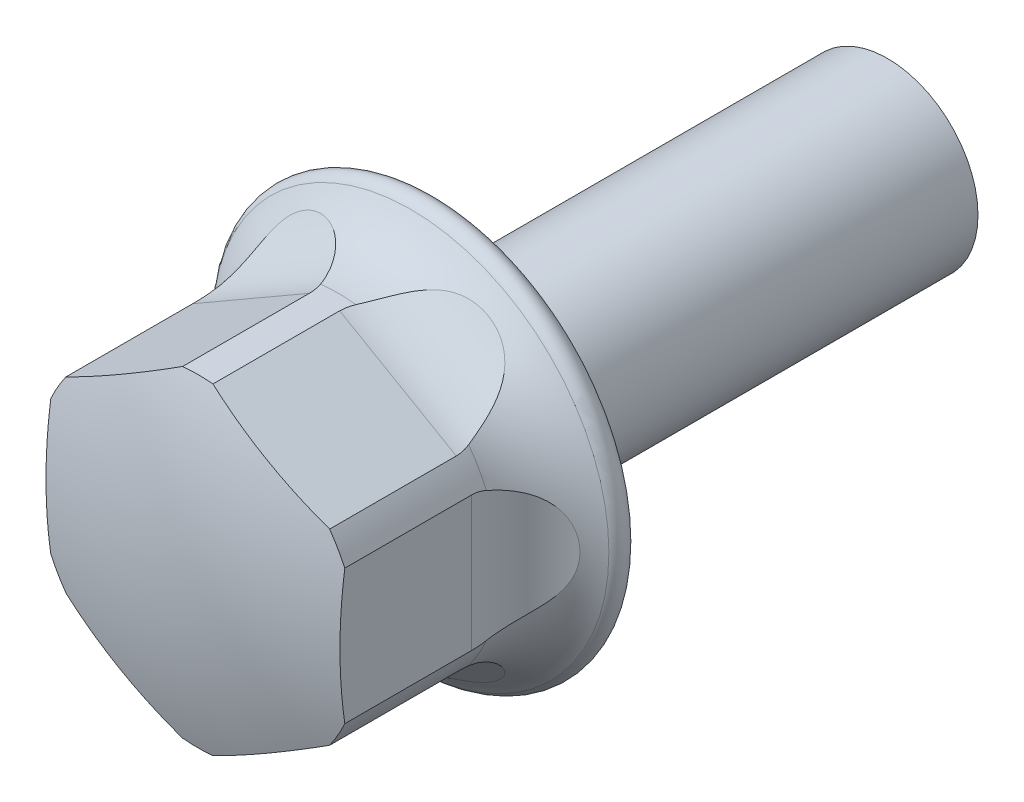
ISO-10303-21;
HEADER;
FILE_DESCRIPTION(('STEP AP214'),'2;1');
FILE_NAME('part.step','',(''),(''),'','','');
FILE_SCHEMA(('AUTOMOTIVE_DESIGN { 1 0 10303 214 1 1 1 1 }'));
ENDSEC;
DATA;
#1=APPLICATION_CONTEXT('core data for automotive mechanical design processes');
#2=APPLICATION_PROTOCOL_DEFINITION('international standard','automotive_design',2000,#1);
#3=PRODUCT_CONTEXT('',#1,'mechanical');
#4=PRODUCT('Part','Part','',(#3));
#5=PRODUCT_RELATED_PRODUCT_CATEGORY('part','',(#4));
#6=PRODUCT_DEFINITION_FORMATION('','',#4);
#7=PRODUCT_DEFINITION_CONTEXT('part definition',#1,'design');
#8=PRODUCT_DEFINITION('design','',#6,#7);
#9=PRODUCT_DEFINITION_SHAPE('','',#8);
#10=(LENGTH_UNIT() NAMED_UNIT(*) SI_UNIT(.MILLI.,.METRE.));
#11=(NAMED_UNIT(*) PLANE_ANGLE_UNIT() SI_UNIT($,.RADIAN.));
#12=(NAMED_UNIT(*) SI_UNIT($,.STERADIAN.) SOLID_ANGLE_UNIT());
#13=UNCERTAINTY_MEASURE_WITH_UNIT(LENGTH_MEASURE(1.E-05),#10,'distance_accuracy_value','');
#14=(GEOMETRIC_REPRESENTATION_CONTEXT(3) GLOBAL_UNCERTAINTY_ASSIGNED_CONTEXT((#13)) GLOBAL_UNIT_ASSIGNED_CONTEXT((#10,
#11,#12)) REPRESENTATION_CONTEXT('',''));
#15=CARTESIAN_POINT('',(0.,0.,0.));
#16=DIRECTION('',(0.,0.,1.));
#17=DIRECTION('',(1.,0.,0.));
#18=AXIS2_PLACEMENT_3D('',#15,#16,#17);
#19=CARTESIAN_POINT('',(0.,0.,0.));
#20=DIRECTION('',(0.,0.,1.));
#21=DIRECTION('',(1.,0.,0.));
#22=AXIS2_PLACEMENT_3D('',#19,#20,#21);
#23=CYLINDRICAL_SURFACE('',#22,7.15);
#24=DIRECTION('',(0.,0.,-1.));
#25=VECTOR('',#24,1.);
#26=CARTESIAN_POINT('',(0.670392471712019,7.1185022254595,11.7));
#27=LINE('',#26,#25);
#28=CARTESIAN_POINT('',(0.670392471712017,7.1185022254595,10.5016762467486));
#29=VERTEX_POINT('',#28);
#30=CARTESIAN_POINT('',(0.670392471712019,7.1185022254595,4.9));
#31=VERTEX_POINT('',#30);
#32=EDGE_CURVE('E306',#29,#31,#27,.T.);
#33=ORIENTED_EDGE('',*,*,#32,.T.);
#34=CARTESIAN_POINT('',(5.82960752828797,4.13982802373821,4.9));
#35=CARTESIAN_POINT('',(5.82960211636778,4.13984064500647,4.99617484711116));
#36=CARTESIAN_POINT('',(5.82476639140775,4.14667190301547,5.09246736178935));
#37=CARTESIAN_POINT('',(5.80553023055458,4.17355648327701,5.28234738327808));
#38=CARTESIAN_POINT('',(5.79110781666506,4.19364018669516,5.37592815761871));
#39=CARTESIAN_POINT('',(5.75316769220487,4.24553649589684,5.55736676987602));
#40=CARTESIAN_POINT('',(5.72968862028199,4.27729924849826,5.64524709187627));
#41=CARTESIAN_POINT('',(5.67424028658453,4.35058609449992,5.81386863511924));
#42=CARTESIAN_POINT('',(5.64227327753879,4.39210759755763,5.89461174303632));
#43=CARTESIAN_POINT('',(5.5670972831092,4.4870837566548,6.05529564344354));
#44=CARTESIAN_POINT('',(5.52310330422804,4.54130162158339,6.13441409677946));
#45=CARTESIAN_POINT('',(5.42674149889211,4.65602944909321,6.28227784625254));
#46=CARTESIAN_POINT('',(5.37436740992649,4.71654410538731,6.35101530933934));
#47=CARTESIAN_POINT('',(5.23381834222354,4.87293573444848,6.51032116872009));
#48=CARTESIAN_POINT('',(5.14092509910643,4.97123117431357,6.5943719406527));
#49=CARTESIAN_POINT('',(4.94114113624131,5.16987038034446,6.74082650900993));
#50=CARTESIAN_POINT('',(4.83421942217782,5.27021825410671,6.80318122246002));
#51=CARTESIAN_POINT('',(4.64973935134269,5.43246313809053,6.88927604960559));
#52=CARTESIAN_POINT('',(4.57550608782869,5.49516978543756,6.91883109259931));
#53=CARTESIAN_POINT('',(4.42293262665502,5.61869995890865,6.97044469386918));
#54=CARTESIAN_POINT('',(4.34459131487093,5.67952296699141,6.99250120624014));
#55=CARTESIAN_POINT('',(4.18434844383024,5.79859476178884,7.0295139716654));
#56=CARTESIAN_POINT('',(4.10244616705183,5.8568430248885,7.04446878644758));
#57=CARTESIAN_POINT('',(3.93555694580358,5.97026591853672,7.0675694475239));
#58=CARTESIAN_POINT('',(3.85056856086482,6.02543908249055,7.07571207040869));
#59=CARTESIAN_POINT('',(3.67706499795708,6.1328804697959,7.08539343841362));
#60=CARTESIAN_POINT('',(3.58852069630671,6.18510850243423,7.08685599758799));
#61=CARTESIAN_POINT('',(3.40941292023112,6.28561421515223,7.08300143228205));
#62=CARTESIAN_POINT('',(3.31885032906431,6.33389358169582,7.07768721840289));
#63=CARTESIAN_POINT('',(3.13626286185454,6.426259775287,7.06017507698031));
#64=CARTESIAN_POINT('',(3.04423811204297,6.47034696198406,7.04797774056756));
#65=CARTESIAN_POINT('',(2.85944107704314,6.55411356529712,7.01645910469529));
#66=CARTESIAN_POINT('',(2.7666689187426,6.59379371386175,6.99713899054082));
#67=CARTESIAN_POINT('',(2.5163643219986,6.6947104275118,6.93490493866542));
#68=CARTESIAN_POINT('',(2.35877045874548,6.75169121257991,6.88493235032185));
#69=CARTESIAN_POINT('',(2.04886790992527,6.8520848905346,6.76087892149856));
#70=CARTESIAN_POINT('',(1.8965521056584,6.89551674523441,6.68683207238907));
#71=CARTESIAN_POINT('',(1.64008295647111,6.96029429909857,6.5330928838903));
#72=CARTESIAN_POINT('',(1.53321305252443,6.98444205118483,6.45913322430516));
#73=CARTESIAN_POINT('',(1.3312306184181,7.02573148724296,6.29493938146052));
#74=CARTESIAN_POINT('',(1.23610235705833,7.04288261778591,6.20472738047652));
#75=CARTESIAN_POINT('',(1.07863661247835,7.06853892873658,6.02607687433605));
#76=CARTESIAN_POINT('',(1.01348065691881,7.07804737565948,5.94027581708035));
#77=CARTESIAN_POINT('',(0.897846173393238,7.09364376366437,5.75893980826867));
#78=CARTESIAN_POINT('',(0.847362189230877,7.09973297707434,5.66340849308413));
#79=CARTESIAN_POINT('',(0.763842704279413,7.10920854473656,5.46407338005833));
#80=CARTESIAN_POINT('',(0.730920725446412,7.11257738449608,5.36022063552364));
#81=CARTESIAN_POINT('',(0.685368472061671,7.11711428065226,5.1480998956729));
#82=CARTESIAN_POINT('',(0.672727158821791,7.118283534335,5.03983433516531));
#83=CARTESIAN_POINT('',(0.668873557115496,7.11864420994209,4.83501332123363));
#84=CARTESIAN_POINT('',(0.675435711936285,7.11804101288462,4.73849376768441));
#85=CARTESIAN_POINT('',(0.704885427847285,7.11518467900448,4.54803038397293));
#86=CARTESIAN_POINT('',(0.727770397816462,7.11293180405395,4.45408614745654));
#87=CARTESIAN_POINT('',(0.788080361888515,7.10649846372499,4.27270193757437));
#88=CARTESIAN_POINT('',(0.825278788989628,7.10234785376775,4.18518473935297));
#89=CARTESIAN_POINT('',(0.912345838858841,7.09168824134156,4.01689711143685));
#90=CARTESIAN_POINT('',(0.962217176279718,7.08517873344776,3.93612813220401));
#91=CARTESIAN_POINT('',(1.07796380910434,7.06853769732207,3.77482528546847));
#92=CARTESIAN_POINT('',(1.14493762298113,7.05811027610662,3.69511407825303));
#93=CARTESIAN_POINT('',(1.28871292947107,7.03328230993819,3.54586442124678));
#94=CARTESIAN_POINT('',(1.3655209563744,7.01887911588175,3.47633280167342));
#95=CARTESIAN_POINT('',(1.56627869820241,6.97741126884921,3.31546538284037));
#96=CARTESIAN_POINT('',(1.69471623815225,6.94760986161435,3.23041808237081));
#97=CARTESIAN_POINT('',(1.96075437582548,6.8772783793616,3.0815549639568));
#98=CARTESIAN_POINT('',(2.09837487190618,6.83672439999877,3.01778717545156));
#99=CARTESIAN_POINT('',(2.32739896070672,6.76126171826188,2.9289485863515));
#100=CARTESIAN_POINT('',(2.41772189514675,6.72952434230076,2.89819544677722));
#101=CARTESIAN_POINT('',(2.59896665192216,6.66162333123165,2.84412740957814));
#102=CARTESIAN_POINT('',(2.68988863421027,6.62545846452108,2.82081458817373));
#103=CARTESIAN_POINT('',(2.87145143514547,6.54881558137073,2.78122250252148));
#104=CARTESIAN_POINT('',(2.96209219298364,6.50833669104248,2.76494466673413));
#105=CARTESIAN_POINT('',(3.14241752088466,6.42321237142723,2.73911377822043));
#106=CARTESIAN_POINT('',(3.23210162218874,6.37856499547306,2.72956388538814));
#107=CARTESIAN_POINT('',(3.41096316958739,6.28475572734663,2.71693789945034));
#108=CARTESIAN_POINT('',(3.50012064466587,6.23554484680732,2.71394330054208));
#109=CARTESIAN_POINT('',(3.67619529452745,6.13338758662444,2.71460764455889));
#110=CARTESIAN_POINT('',(3.76311336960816,6.08044274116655,2.71826386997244));
#111=CARTESIAN_POINT('',(3.93422805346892,5.97115196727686,2.73229823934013));
#112=CARTESIAN_POINT('',(4.01842467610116,5.91480605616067,2.74267634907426));
#113=CARTESIAN_POINT('',(4.18358488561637,5.79916163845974,2.77035982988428));
#114=CARTESIAN_POINT('',(4.26454891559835,5.73986353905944,2.78766424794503));
#115=CARTESIAN_POINT('',(4.41277037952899,5.62650290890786,2.82689552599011));
#116=CARTESIAN_POINT('',(4.48046993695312,5.5727214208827,2.84796587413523));
#117=CARTESIAN_POINT('',(4.61264235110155,5.46382282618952,2.89594527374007));
#118=CARTESIAN_POINT('',(4.67711575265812,5.40870594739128,2.92285333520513));
#119=CARTESIAN_POINT('',(4.80240197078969,5.29777544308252,2.98283389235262));
#120=CARTESIAN_POINT('',(4.86321808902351,5.24196250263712,3.01590071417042));
#121=CARTESIAN_POINT('',(4.98079951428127,5.13037172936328,3.08857321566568));
#122=CARTESIAN_POINT('',(5.03756600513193,5.07459389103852,3.12817697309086));
#123=CARTESIAN_POINT('',(5.17430584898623,4.93586001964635,3.23620146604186));
#124=CARTESIAN_POINT('',(5.25144696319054,4.85346770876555,3.30905020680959));
#125=CARTESIAN_POINT('',(5.39361798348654,4.69496631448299,3.47145127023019));
#126=CARTESIAN_POINT('',(5.45866469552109,4.61884859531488,3.56098006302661));
#127=CARTESIAN_POINT('',(5.56398546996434,4.49111596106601,3.7385577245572));
#128=CARTESIAN_POINT('',(5.60661636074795,4.4375737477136,3.82381115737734));
#129=CARTESIAN_POINT('',(5.68149281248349,4.34129812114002,4.00449170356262));
#130=CARTESIAN_POINT('',(5.71374214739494,4.29856078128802,4.09991510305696));
#131=CARTESIAN_POINT('',(5.7638379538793,4.23110382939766,4.28747356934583));
#132=CARTESIAN_POINT('',(5.782907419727,4.20488539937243,4.37874291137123));
#133=CARTESIAN_POINT('',(5.81158457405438,4.16516569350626,4.56530302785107));
#134=CARTESIAN_POINT('',(5.82121625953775,4.15163216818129,4.66058295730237));
#135=CARTESIAN_POINT('',(5.82841404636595,4.14150782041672,4.80420158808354));
#136=CARTESIAN_POINT('',(5.82961022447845,4.13982173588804,4.85208619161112));
#137=CARTESIAN_POINT('',(5.82960752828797,4.13982802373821,4.9));
#138=B_SPLINE_CURVE_WITH_KNOTS('',3,(#34,#35,#36,#37,#38,#39,#40,#41,#42,#43,#44,#45,#46,#47,
#48,#49,#50,#51,#52,#53,#54,#55,#56,#57,#58,#59,#60,#61,#62,#63,#64,#65,#66,#67,#68,#69,#70,#71,
#72,#73,#74,#75,#76,#77,#78,#79,#80,#81,#82,#83,#84,#85,#86,#87,#88,#89,#90,#91,#92,#93,#94,#95,
#96,#97,#98,#99,#100,#101,#102,#103,#104,#105,#106,#107,#108,#109,#110,#111,#112,#113,#114,#115,
#116,#117,#118,#119,#120,#121,#122,#123,#124,#125,#126,#127,#128,#129,#130,#131,#132,#133,#134,
#135,#136,#137),.UNSPECIFIED.,.T.,.F.,(4,2,2,2,2,2,2,2,2,2,2,2,2,2,2,2,2,2,2,2,2,2,2,2,2,2,2,2,
2,2,2,2,2,2,2,2,2,2,2,2,2,2,2,2,2,2,2,2,2,2,2,4),(0.,0.288374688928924,0.577412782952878,
0.865231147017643,1.15297319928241,1.46835945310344,1.78398250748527,2.25907789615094,
2.73524120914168,3.03959799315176,3.34403775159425,3.64853914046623,3.95318453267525,
4.26129586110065,4.56927490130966,4.87722749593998,5.18512886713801,5.70767059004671,
6.22947769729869,6.62463072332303,7.01924844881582,7.3424018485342,7.66543492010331,
7.99053154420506,8.31545115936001,8.60425778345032,8.8930185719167,9.1773850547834,
9.46181250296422,9.77453409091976,10.0874645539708,10.5555918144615,11.0247686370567,
11.3260849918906,11.6274853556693,11.9289468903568,12.230549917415,12.5358816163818,
12.8410885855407,13.1462940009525,13.451457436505,13.7181920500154,13.9848814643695,
14.2513263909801,14.5176931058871,14.9191569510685,15.3200586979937,15.6467290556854,
15.9732805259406,16.2625967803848,16.5511754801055,16.694842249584),.UNSPECIFIED.);
#139=CARTESIAN_POINT('',(0.78506631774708,7.10676936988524,4.28747881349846));
#140=VERTEX_POINT('',#139);
#141=EDGE_CURVE('E462',#31,#140,#138,.T.);
#142=ORIENTED_EDGE('',*,*,#141,.T.);
#143=CARTESIAN_POINT('',(0.,0.,4.28747881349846));
#144=DIRECTION('',(0.,0.,1.));
#145=DIRECTION('',(1.,0.,0.));
#146=AXIS2_PLACEMENT_3D('',#143,#144,#145);
#147=CIRCLE('',#146,7.15);
#148=CARTESIAN_POINT('',(-0.78506631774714,7.10676936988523,4.28747881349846));
#149=VERTEX_POINT('',#148);
#150=EDGE_CURVE('E357',#149,#140,#147,.F.);
#151=ORIENTED_EDGE('',*,*,#150,.F.);
#152=CARTESIAN_POINT('',(-0.670392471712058,7.1185022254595,4.9));
#153=CARTESIAN_POINT('',(-0.670406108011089,7.11850384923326,4.99617484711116));
#154=CARTESIAN_POINT('',(-0.678740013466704,7.11773161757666,5.09246736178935));
#155=CARTESIAN_POINT('',(-0.711640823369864,7.1145149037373,5.28234738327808));
#156=CARTESIAN_POINT('',(-0.736245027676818,7.11206657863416,5.37592815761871));
#157=CARTESIAN_POINT('',(-0.800158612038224,7.10515762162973,5.55736676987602));
#158=CARTESIAN_POINT('',(-0.839405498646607,7.10070552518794,5.64524709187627));
#159=CARTESIAN_POINT('',(-0.930597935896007,7.08932928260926,5.81386863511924));
#160=CARTESIAN_POINT('',(-0.982540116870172,7.08240579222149,5.89461174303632));
#161=CARTESIAN_POINT('',(-1.102379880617,7.0647895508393,6.05529564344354));
#162=CARTESIAN_POINT('',(-1.17133091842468,7.05379857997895,6.13441409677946));
#163=CARTESIAN_POINT('',(-1.31886903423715,7.02771072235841,6.28227784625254));
#164=CARTESIAN_POINT('',(-1.39746330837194,7.01261075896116,6.35101530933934));
#165=CARTESIAN_POINT('',(-1.60317696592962,6.96908751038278,6.51032116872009));
#166=CARTESIAN_POINT('',(-1.7347499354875,6.93778732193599,6.5943719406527));
#167=CARTESIAN_POINT('',(-2.00666851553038,6.8640889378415,6.74082650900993));
#168=CARTESIAN_POINT('',(-2.147033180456,6.82166595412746,6.80318122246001));
#169=CARTESIAN_POINT('',(-2.3797814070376,6.74302396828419,6.88927604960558));
#170=CARTESIAN_POINT('',(-2.47120358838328,6.71008939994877,6.91883109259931));
#171=CARTESIAN_POINT('',(-2.65447058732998,6.6397219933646,6.97044469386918));
#172=CARTESIAN_POINT('',(-2.74631551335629,6.60228793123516,6.99250120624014));
#173=CARTESIAN_POINT('',(-2.92955614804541,6.52304943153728,7.0295139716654));
#174=CARTESIAN_POINT('',(-3.02095176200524,6.48124411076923,7.04446878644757));
#175=CARTESIAN_POINT('',(-3.20262347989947,6.39342525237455,7.0675694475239));
#176=CARTESIAN_POINT('',(-3.29289903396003,6.34740973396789,7.07571207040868));
#177=CARTESIAN_POINT('',(-3.47269778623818,6.25087193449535,7.08539343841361));
#178=CARTESIAN_POINT('',(-3.56220074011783,6.20030433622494,7.08685599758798));
#179=CARTESIAN_POINT('',(-3.73879512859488,6.09544530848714,7.08300143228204));
#180=CARTESIAN_POINT('',(-3.82588758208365,6.04115548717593,7.07768721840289));
#181=CARTESIAN_POINT('',(-3.99717278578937,5.9292131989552,7.0601750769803));
#182=CARTESIAN_POINT('',(-4.08136578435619,5.87156102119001,7.04797774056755));
#183=CARTESIAN_POINT('',(-4.24630830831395,5.75340539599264,7.01645910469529));
#184=CARTESIAN_POINT('',(-4.32705840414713,5.69290242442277,6.99713899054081));
#185=CARTESIAN_POINT('',(-4.53960714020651,5.52659064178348,6.93490493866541));
#186=CARTESIAN_POINT('',(-4.66775087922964,5.4186007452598,6.88493235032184));
#187=CARTESIAN_POINT('',(-4.90964562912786,5.2004141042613,6.76087892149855));
#188=CARTESIAN_POINT('',(-5.02341662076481,5.09022067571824,6.68683207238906));
#189=CARTESIAN_POINT('',(-5.20775020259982,4.90050065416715,6.53309288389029));
#190=CARTESIAN_POINT('',(-5.28209772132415,4.82002247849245,6.45913322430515));
#191=CARTESIAN_POINT('',(-5.41884663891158,4.66574527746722,6.29493938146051));
#192=CARTESIAN_POINT('',(-5.4812640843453,4.59193735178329,6.20472738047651));
#193=CARTESIAN_POINT('',(-5.58221597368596,4.46839617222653,6.02607687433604));
#194=CARTESIAN_POINT('',(-5.62302850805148,4.41672368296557,5.94027581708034));
#195=CARTESIAN_POINT('',(-5.69435261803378,4.32437947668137,5.75893980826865));
#196=CARTESIAN_POINT('',(-5.72486802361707,4.2837036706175,5.66340849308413));
#197=CARTESIAN_POINT('',(-5.77483384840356,4.21611145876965,5.46407338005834));
#198=CARTESIAN_POINT('',(-5.79421233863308,4.18928460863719,5.36022063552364));
#199=CARTESIAN_POINT('',(-5.82091753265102,4.15210364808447,5.14809989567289));
#200=CARTESIAN_POINT('',(-5.82825079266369,4.14174057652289,5.03983433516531));
#201=CARTESIAN_POINT('',(-5.83048994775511,4.13858359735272,4.83501332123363));
#202=CARTESIAN_POINT('',(-5.82668648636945,4.14396499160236,4.73849376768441));
#203=CARTESIAN_POINT('',(-5.80948797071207,4.16804102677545,4.54803038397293));
#204=CARTESIAN_POINT('',(-5.79609443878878,4.18673355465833,4.45408614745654));
#205=CARTESIAN_POINT('',(-5.76036802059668,4.23574684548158,4.27270193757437));
#206=CARTESIAN_POINT('',(-5.73817427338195,4.26588632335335,4.18518473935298));
#207=CARTESIAN_POINT('',(-5.68540925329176,4.33595879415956,4.01689711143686));
#208=CARTESIAN_POINT('',(-5.65483618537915,4.37589388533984,3.93612813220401));
#209=CARTESIAN_POINT('',(-5.5825513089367,4.46781289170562,3.77482528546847));
#210=CARTESIAN_POINT('',(-5.54003399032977,4.52060020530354,3.69511407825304));
#211=CARTESIAN_POINT('',(-5.44664468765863,4.6326992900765,3.54586442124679));
#212=CARTESIAN_POINT('',(-5.39576714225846,4.69201539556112,3.47633280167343));
#213=CARTESIAN_POINT('',(-5.25947606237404,4.84514277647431,3.31546538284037));
#214=CARTESIAN_POINT('',(-5.16944851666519,4.94147224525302,3.23041808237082));
#215=CARTESIAN_POINT('',(-4.97552059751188,5.13670228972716,3.08155496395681));
#216=CARTESIAN_POINT('',(-4.87158957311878,5.23560814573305,3.01778717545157));
#217=CARTESIAN_POINT('',(-4.69172492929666,5.39621748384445,2.9289485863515));
#218=CARTESIAN_POINT('',(-4.61907808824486,5.45857075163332,2.89819544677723));
#219=CARTESIAN_POINT('',(-4.46965170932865,5.581582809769,2.84412740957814));
#220=CARTESIAN_POINT('',(-4.39287102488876,5.64224112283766,2.82081458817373));
#221=CARTESIAN_POINT('',(-4.23571494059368,5.76115767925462,2.78122250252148));
#222=CARTESIAN_POINT('',(-4.15533881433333,5.81941543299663,2.76494466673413));
#223=CARTESIAN_POINT('',(-3.99145632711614,5.93301958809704,2.73911377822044));
#224=CARTESIAN_POINT('',(-3.90794851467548,5.98836461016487,2.72956388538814));
#225=CARTESIAN_POINT('',(-3.73727653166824,6.09635861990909,2.71693789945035));
#226=CARTESIAN_POINT('',(-3.65007992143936,6.14896581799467,2.71394330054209));
#227=CARTESIAN_POINT('',(-3.47357181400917,6.25037230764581,2.7146076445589));
#228=CARTESIAN_POINT('',(-3.38426119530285,6.2991731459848,2.71826386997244));
#229=CARTESIAN_POINT('',(-3.20405526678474,6.39271742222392,2.73229823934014));
#230=CARTESIAN_POINT('',(-3.11315996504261,6.43746088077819,2.74267634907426));
#231=CARTESIAN_POINT('',(-2.93042885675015,6.52267160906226,2.77035982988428));
#232=CARTESIAN_POINT('',(-2.83859318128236,6.56313946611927,2.78766424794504));
#233=CARTESIAN_POINT('',(-2.66630926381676,6.63482270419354,2.82689552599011));
#234=CARTESIAN_POINT('',(-2.58588335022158,6.66656149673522,2.84796587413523));
#235=CARTESIAN_POINT('',(-2.42548819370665,6.72657686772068,2.89594527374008));
#236=CARTESIAN_POINT('',(-2.34551887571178,6.75485403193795,2.92285333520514));
#237=CARTESIAN_POINT('',(-2.18680713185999,6.80788982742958,2.98283389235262));
#238=CARTESIAN_POINT('',(-2.10806364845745,6.83265166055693,3.01590071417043));
#239=CARTESIAN_POINT('',(-1.95263249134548,6.87868477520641,3.08857321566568));
#240=CARTESIAN_POINT('',(-1.87594422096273,6.89995707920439,3.12817697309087));
#241=CARTESIAN_POINT('',(-1.6874272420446,6.94901032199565,3.23620146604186));
#242=CARTESIAN_POINT('',(-1.57750285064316,6.97462033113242,3.30905020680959));
#243=CARTESIAN_POINT('',(-1.36915110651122,7.01849334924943,3.4714512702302));
#244=CARTESIAN_POINT('',(-1.27070787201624,7.03676659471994,3.56098006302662));
#245=CARTESIAN_POINT('',(-1.10742777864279,7.06411074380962,3.7385577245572));
#246=CARTESIAN_POINT('',(-1.03974341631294,7.07425907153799,3.82381115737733));
#247=CARTESIAN_POINT('',(-0.918928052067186,7.09096616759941,4.00449170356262));
#248=CARTESIAN_POINT('',(-0.865791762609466,7.09752624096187,4.09991510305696));
#249=CARTESIAN_POINT('',(-0.782324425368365,7.10718200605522,4.28747356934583));
#250=CARTESIAN_POINT('',(-0.75008386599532,7.11058743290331,4.37874291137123));
#251=CARTESIAN_POINT('',(-0.701347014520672,7.11556272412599,4.56530302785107));
#252=CARTESIAN_POINT('',(-0.684810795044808,7.11713724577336,4.66058295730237));
#253=CARTESIAN_POINT('',(-0.672443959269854,7.11830853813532,4.80420158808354));
#254=CARTESIAN_POINT('',(-0.670385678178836,7.11850141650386,4.85208619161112));
#255=CARTESIAN_POINT('',(-0.670392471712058,7.1185022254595,4.9));
#256=B_SPLINE_CURVE_WITH_KNOTS('',3,(#152,#153,#154,#155,#156,#157,#158,#159,#160,#161,#162,
#163,#164,#165,#166,#167,#168,#169,#170,#171,#172,#173,#174,#175,#176,#177,#178,#179,#180,#181,
#182,#183,#184,#185,#186,#187,#188,#189,#190,#191,#192,#193,#194,#195,#196,#197,#198,#199,#200,
#201,#202,#203,#204,#205,#206,#207,#208,#209,#210,#211,#212,#213,#214,#215,#216,#217,#218,#219,
#220,#221,#222,#223,#224,#225,#226,#227,#228,#229,#230,#231,#232,#233,#234,#235,#236,#237,#238,
#239,#240,#241,#242,#243,#244,#245,#246,#247,#248,#249,#250,#251,#252,#253,#254,#255),
.UNSPECIFIED.,.T.,.F.,(4,2,2,2,2,2,2,2,2,2,2,2,2,2,2,2,2,2,2,2,2,2,2,2,2,2,2,2,2,2,2,2,2,2,2,2,
2,2,2,2,2,2,2,2,2,2,2,2,2,2,2,4),(0.,0.288374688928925,0.57741278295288,0.865231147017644,
1.15297319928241,1.46835945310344,1.78398250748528,2.25907789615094,2.73524120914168,
3.03959799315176,3.34403775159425,3.64853914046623,3.95318453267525,4.26129586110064,
4.56927490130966,4.87722749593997,5.18512886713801,5.7076705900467,6.22947769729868,
6.62463072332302,7.01924844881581,7.34240184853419,7.66543492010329,7.99053154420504,
8.31545115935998,8.6042577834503,8.89301857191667,9.17738505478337,9.46181250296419,
9.77453409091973,10.0874645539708,10.5555918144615,11.0247686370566,11.3260849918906,
11.6274853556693,11.9289468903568,12.230549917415,12.5358816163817,12.8410885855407,
13.1462940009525,13.451457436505,13.7181920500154,13.9848814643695,14.25132639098,
14.517693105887,14.9191569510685,15.3200586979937,15.6467290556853,15.9732805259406,
16.2625967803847,16.5511754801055,16.6948422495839),.UNSPECIFIED.);
#257=CARTESIAN_POINT('',(-0.670392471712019,7.11850222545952,4.9));
#258=VERTEX_POINT('',#257);
#259=EDGE_CURVE('E311',#149,#258,#256,.T.);
#260=ORIENTED_EDGE('',*,*,#259,.T.);
#261=DIRECTION('',(0.,0.,-1.));
#262=VECTOR('',#261,1.);
#263=CARTESIAN_POINT('',(-0.670392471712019,7.1185022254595,11.7));
#264=LINE('',#263,#262);
#265=CARTESIAN_POINT('',(-0.67039247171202,7.1185022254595,10.5016762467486));
#266=VERTEX_POINT('',#265);
#267=EDGE_CURVE('E309',#266,#258,#264,.T.);
#268=ORIENTED_EDGE('',*,*,#267,.F.);
#269=CARTESIAN_POINT('',(0.,0.,10.5016762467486));
#270=DIRECTION('',(0.,0.,1.));
#271=DIRECTION('',(1.,0.,0.));
#272=AXIS2_PLACEMENT_3D('',#269,#270,#271);
#273=CIRCLE('',#272,7.15);
#274=EDGE_CURVE('E194',#29,#266,#273,.T.);
#275=ORIENTED_EDGE('',*,*,#274,.F.);
#276=EDGE_LOOP('',(#33,#142,#151,#260,#268,#275));
#277=FACE_BOUND('',#276,.T.);
#278=ADVANCED_FACE('F16',(#277),#23,.T.);
#279=DIRECTION('',(0.,0.,-1.));
#280=VECTOR('',#279,1.);
#281=CARTESIAN_POINT('',(-5.82960752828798,4.1398280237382,11.7));
#282=LINE('',#281,#280);
#283=CARTESIAN_POINT('',(-5.82960752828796,4.13982802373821,10.5016762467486));
#284=VERTEX_POINT('',#283);
#285=CARTESIAN_POINT('',(-5.82960752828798,4.1398280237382,4.9));
#286=VERTEX_POINT('',#285);
#287=EDGE_CURVE('E316',#284,#286,#282,.T.);
#288=ORIENTED_EDGE('',*,*,#287,.T.);
#289=CARTESIAN_POINT('',(-5.76210965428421,4.23327205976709,4.28747881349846));
#290=VERTEX_POINT('',#289);
#291=EDGE_CURVE('E648',#286,#290,#256,.T.);
#292=ORIENTED_EDGE('',*,*,#291,.T.);
#293=CARTESIAN_POINT('',(-6.54717597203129,2.87349731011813,4.28747881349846));
#294=VERTEX_POINT('',#293);
#295=EDGE_CURVE('E345',#294,#290,#147,.F.);
#296=ORIENTED_EDGE('',*,*,#295,.F.);
#297=CARTESIAN_POINT('',(-7.15,0.,2.71425070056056));
#298=CARTESIAN_POINT('',(-7.1500021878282,0.0976074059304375,2.71425253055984));
#299=CARTESIAN_POINT('',(-7.14799956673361,0.195190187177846,2.71730889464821));
#300=CARTESIAN_POINT('',(-7.14002999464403,0.389798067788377,2.72959418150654));
#301=CARTESIAN_POINT('',(-7.13406390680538,0.486823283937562,2.73882176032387));
#302=CARTESIAN_POINT('',(-7.11825669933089,0.679948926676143,2.76364141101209));
#303=CARTESIAN_POINT('',(-7.10840742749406,0.776046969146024,2.77924687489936));
#304=CARTESIAN_POINT('',(-7.08503296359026,0.966436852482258,2.81709444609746));
#305=CARTESIAN_POINT('',(-7.07150941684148,1.06072948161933,2.83933358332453));
#306=CARTESIAN_POINT('',(-7.04094946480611,1.24762597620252,2.89105004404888));
#307=CARTESIAN_POINT('',(-7.02388412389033,1.34020862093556,2.92058739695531));
#308=CARTESIAN_POINT('',(-6.98674520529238,1.52200482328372,2.98727981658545));
#309=CARTESIAN_POINT('',(-6.96667103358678,1.61121771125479,3.02443638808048));
#310=CARTESIAN_POINT('',(-6.92418362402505,1.78497971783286,3.10676918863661));
#311=CARTESIAN_POINT('',(-6.90177735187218,1.86954163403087,3.15192180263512));
#312=CARTESIAN_POINT('',(-6.85541078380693,2.03299274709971,3.25077392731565));
#313=CARTESIAN_POINT('',(-6.83145162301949,2.11188600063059,3.30446723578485));
#314=CARTESIAN_POINT('',(-6.7775604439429,2.27959396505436,3.43391584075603));
#315=CARTESIAN_POINT('',(-6.74749436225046,2.36666355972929,3.51191819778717));
#316=CARTESIAN_POINT('',(-6.68905169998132,2.52713148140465,3.68151997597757));
#317=CARTESIAN_POINT('',(-6.66067434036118,2.60053614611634,3.77311305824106));
#318=CARTESIAN_POINT('',(-6.60828884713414,2.73093801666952,3.96993038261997));
#319=CARTESIAN_POINT('',(-6.58432518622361,2.78777126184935,4.07527683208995));
#320=CARTESIAN_POINT('',(-6.54425262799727,2.88060103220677,4.29618793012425));
#321=CARTESIAN_POINT('',(-6.52813504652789,2.91662060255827,4.41174111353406));
#322=CARTESIAN_POINT('',(-6.50776716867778,2.96175259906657,4.63099565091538));
#323=CARTESIAN_POINT('',(-6.50211171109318,2.97406252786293,4.73391418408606));
#324=CARTESIAN_POINT('',(-6.49887467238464,2.98113293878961,4.94046262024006));
#325=CARTESIAN_POINT('',(-6.50128902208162,2.97590226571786,5.04409213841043));
#326=CARTESIAN_POINT('',(-6.51333186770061,2.94943728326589,5.23943354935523));
#327=CARTESIAN_POINT('',(-6.52230414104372,2.9296577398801,5.33138945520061));
#328=CARTESIAN_POINT('',(-6.54584015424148,2.87668402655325,5.51056307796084));
#329=CARTESIAN_POINT('',(-6.56040379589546,2.84349009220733,5.59778087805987));
#330=CARTESIAN_POINT('',(-6.59455477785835,2.76338665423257,5.76917113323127));
#331=CARTESIAN_POINT('',(-6.61432649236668,2.71596232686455,5.85306436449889));
#332=CARTESIAN_POINT('',(-6.65692438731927,2.60981462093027,6.01247117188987));
#333=CARTESIAN_POINT('',(-6.67975217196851,2.55108530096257,6.08798030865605));
#334=CARTESIAN_POINT('',(-6.73651563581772,2.39810603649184,6.25916618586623));
#335=CARTESIAN_POINT('',(-6.771168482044,2.29916456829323,6.35042009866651));
#336=CARTESIAN_POINT('',(-6.83951512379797,2.08709714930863,6.51519621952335));
#337=CARTESIAN_POINT('',(-6.87320679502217,1.97394237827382,6.58868148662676));
#338=CARTESIAN_POINT('',(-6.92577548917,1.77836802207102,6.69642781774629));
#339=CARTESIAN_POINT('',(-6.94575381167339,1.69881081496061,6.73547518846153));
#340=CARTESIAN_POINT('',(-6.98351823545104,1.53621317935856,6.80682440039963));
#341=CARTESIAN_POINT('',(-7.00130366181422,1.45317168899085,6.83912416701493));
#342=CARTESIAN_POINT('',(-7.05067491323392,1.19996971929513,6.92650296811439));
#343=CARTESIAN_POINT('',(-7.07829061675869,1.02567768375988,6.97209013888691));
#344=CARTESIAN_POINT('',(-7.12106388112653,0.667942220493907,7.04112953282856));
#345=CARTESIAN_POINT('',(-7.13597009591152,0.484386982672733,7.06413648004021));
#346=CARTESIAN_POINT('',(-7.15145962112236,0.115072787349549,7.08803541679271));
#347=CARTESIAN_POINT('',(-7.15203403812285,-0.070687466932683,7.08891367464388));
#348=CARTESIAN_POINT('',(-7.14157176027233,-0.363626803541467,7.07277886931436));
#349=CARTESIAN_POINT('',(-7.13525145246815,-0.471446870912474,7.06303436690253));
#350=CARTESIAN_POINT('',(-7.11784924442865,-0.685756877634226,7.03572705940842));
#351=CARTESIAN_POINT('',(-7.10676626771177,-0.792246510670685,7.01816248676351));
#352=CARTESIAN_POINT('',(-7.08010918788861,-1.00290384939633,6.97484764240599));
#353=CARTESIAN_POINT('',(-7.06453845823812,-1.10707323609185,6.94910351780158));
#354=CARTESIAN_POINT('',(-7.02934492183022,-1.31211077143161,6.88891000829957));
#355=CARTESIAN_POINT('',(-7.0097239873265,-1.41298042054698,6.85446464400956));
#356=CARTESIAN_POINT('',(-6.95872664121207,-1.64870018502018,6.76098237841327));
#357=CARTESIAN_POINT('',(-6.92574464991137,-1.78152733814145,6.69759057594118));
#358=CARTESIAN_POINT('',(-6.85569658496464,-2.03447549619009,6.55094671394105));
#359=CARTESIAN_POINT('',(-6.81863752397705,-2.15461764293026,6.46772847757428));
#360=CARTESIAN_POINT('',(-6.75207476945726,-2.35385692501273,6.29978569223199));
#361=CARTESIAN_POINT('',(-6.7226111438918,-2.43628411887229,6.21901267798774));
#362=CARTESIAN_POINT('',(-6.66609488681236,-2.58691713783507,6.04435984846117));
#363=CARTESIAN_POINT('',(-6.63903980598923,-2.65513750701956,5.95049360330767));
#364=CARTESIAN_POINT('',(-6.59387360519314,-2.76520256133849,5.76591009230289));
#365=CARTESIAN_POINT('',(-6.57503009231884,-2.8094653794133,5.67681878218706));
#366=CARTESIAN_POINT('',(-6.54291277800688,-2.88347541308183,5.49182120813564));
#367=CARTESIAN_POINT('',(-6.52963681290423,-2.91322826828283,5.39591760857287));
#368=CARTESIAN_POINT('',(-6.50999900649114,-2.9568567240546,5.19944531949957));
#369=CARTESIAN_POINT('',(-6.50366441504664,-2.97066976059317,5.09885984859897));
#370=CARTESIAN_POINT('',(-6.49872372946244,-2.9814645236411,4.89660015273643));
#371=CARTESIAN_POINT('',(-6.5001162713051,-2.9784492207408,4.79492612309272));
#372=CARTESIAN_POINT('',(-6.5100993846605,-2.95655638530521,4.60085612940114));
#373=CARTESIAN_POINT('',(-6.51818509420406,-2.93879115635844,4.50830506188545));
#374=CARTESIAN_POINT('',(-6.54011517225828,-2.88965582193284,4.32763822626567));
#375=CARTESIAN_POINT('',(-6.5539595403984,-2.85828571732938,4.2395224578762));
#376=CARTESIAN_POINT('',(-6.58672949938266,-2.78195297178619,4.06674379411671));
#377=CARTESIAN_POINT('',(-6.60581198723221,-2.7365640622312,3.98230047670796));
#378=CARTESIAN_POINT('',(-6.64722739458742,-2.63437134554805,3.82155293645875));
#379=CARTESIAN_POINT('',(-6.66956186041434,-2.57756210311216,3.74525261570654));
#380=CARTESIAN_POINT('',(-6.72508197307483,-2.42984858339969,3.57292089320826));
#381=CARTESIAN_POINT('',(-6.75905836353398,-2.33435752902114,3.48106442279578));
#382=CARTESIAN_POINT('',(-6.82648817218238,-2.129152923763,3.31462534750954));
#383=CARTESIAN_POINT('',(-6.85994035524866,-2.01941019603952,3.24007907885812));
#384=CARTESIAN_POINT('',(-6.93326626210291,-1.75401787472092,3.08678490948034));
#385=CARTESIAN_POINT('',(-6.97192421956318,-1.59467060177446,3.01387400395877));
#386=CARTESIAN_POINT('',(-7.0392357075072,-1.26494434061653,2.89304053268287));
#387=CARTESIAN_POINT('',(-7.06788333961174,-1.09455891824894,2.84513269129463));
#388=CARTESIAN_POINT('',(-7.10997674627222,-0.770595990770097,2.77653605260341));
#389=CARTESIAN_POINT('',(-7.12493314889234,-0.617780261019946,2.75308309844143));
#390=CARTESIAN_POINT('',(-7.14494096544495,-0.309955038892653,2.72194227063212));
#391=CARTESIAN_POINT('',(-7.14999652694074,-0.154946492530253,2.71424779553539));
#392=CARTESIAN_POINT('',(-7.15,0.,2.71425070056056));
#393=B_SPLINE_CURVE_WITH_KNOTS('',3,(#297,#298,#299,#300,#301,#302,#303,#304,#305,#306,#307,
#308,#309,#310,#311,#312,#313,#314,#315,#316,#317,#318,#319,#320,#321,#322,#323,#324,#325,#326,
#327,#328,#329,#330,#331,#332,#333,#334,#335,#336,#337,#338,#339,#340,#341,#342,#343,#344,#345,
#346,#347,#348,#349,#350,#351,#352,#353,#354,#355,#356,#357,#358,#359,#360,#361,#362,#363,#364,
#365,#366,#367,#368,#369,#370,#371,#372,#373,#374,#375,#376,#377,#378,#379,#380,#381,#382,#383,
#384,#385,#386,#387,#388,#389,#390,#391,#392),.UNSPECIFIED.,.T.,.F.,(4,2,2,2,2,2,2,2,2,2,2,2,2,
2,2,2,2,2,2,2,2,2,2,2,2,2,2,2,2,2,2,2,2,2,2,2,2,2,2,2,2,2,2,2,2,2,2,4),(0.,0.292710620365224,
0.585357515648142,0.878622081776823,1.17175554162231,1.46738540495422,1.76307371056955,
2.05790288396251,2.3525189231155,2.71323284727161,3.07377905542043,3.43778011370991,
3.80137736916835,4.11106777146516,4.42060203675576,4.70278866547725,4.98497033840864,
5.27893458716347,5.57305375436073,5.98775092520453,6.40330297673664,6.6755091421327,
6.94779887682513,7.49219180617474,8.0471163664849,8.60238527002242,8.92738191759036,
9.25245206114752,9.5772784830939,9.90195508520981,10.3527677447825,10.8028167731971,
11.1587849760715,11.5143869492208,11.8168436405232,12.1191826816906,12.4227044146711,
12.7261725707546,13.0086370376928,13.2911014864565,13.5831792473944,13.8753963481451,
14.2834987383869,14.6924501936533,15.227938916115,15.7637426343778,16.2285997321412,
16.693262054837),.UNSPECIFIED.);
#394=CARTESIAN_POINT('',(-6.5,2.9786742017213,4.9));
#395=VERTEX_POINT('',#394);
#396=EDGE_CURVE('E337',#294,#395,#393,.T.);
#397=ORIENTED_EDGE('',*,*,#396,.T.);
#398=DIRECTION('',(0.,0.,-1.));
#399=VECTOR('',#398,1.);
#400=CARTESIAN_POINT('',(-6.5,2.9786742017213,11.7));
#401=LINE('',#400,#399);
#402=CARTESIAN_POINT('',(-6.5,2.97867420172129,10.5016762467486));
#403=VERTEX_POINT('',#402);
#404=EDGE_CURVE('E329',#403,#395,#401,.T.);
#405=ORIENTED_EDGE('',*,*,#404,.F.);
#406=EDGE_CURVE('E291',#284,#403,#273,.T.);
#407=ORIENTED_EDGE('',*,*,#406,.F.);
#408=EDGE_LOOP('',(#288,#292,#296,#397,#405,#407));
#409=FACE_BOUND('',#408,.T.);
#410=ADVANCED_FACE('F243',(#409),#23,.T.);
#411=CARTESIAN_POINT('',(5.76210965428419,4.23327205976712,4.28747881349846));
#412=VERTEX_POINT('',#411);
#413=CARTESIAN_POINT('',(6.54717597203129,2.87349731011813,4.28747881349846));
#414=VERTEX_POINT('',#413);
#415=EDGE_CURVE('E193',#412,#414,#147,.F.);
#416=ORIENTED_EDGE('',*,*,#415,.F.);
#417=CARTESIAN_POINT('',(5.82960752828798,4.1398280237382,4.9));
#418=VERTEX_POINT('',#417);
#419=EDGE_CURVE('E463',#412,#418,#138,.T.);
#420=ORIENTED_EDGE('',*,*,#419,.T.);
#421=DIRECTION('',(0.,0.,-1.));
#422=VECTOR('',#421,1.);
#423=CARTESIAN_POINT('',(5.82960752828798,4.1398280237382,11.7));
#424=LINE('',#423,#422);
#425=CARTESIAN_POINT('',(5.82960752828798,4.1398280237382,10.5016762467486));
#426=VERTEX_POINT('',#425);
#427=EDGE_CURVE('E638',#426,#418,#424,.T.);
#428=ORIENTED_EDGE('',*,*,#427,.F.);
#429=CARTESIAN_POINT('',(6.5,2.97867420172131,10.5016762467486));
#430=VERTEX_POINT('',#429);
#431=EDGE_CURVE('E189',#430,#426,#273,.T.);
#432=ORIENTED_EDGE('',*,*,#431,.F.);
#433=DIRECTION('',(0.,0.,-1.));
#434=VECTOR('',#433,1.);
#435=CARTESIAN_POINT('',(6.5,2.9786742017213,11.7));
#436=LINE('',#435,#434);
#437=CARTESIAN_POINT('',(6.5,2.9786742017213,4.9));
#438=VERTEX_POINT('',#437);
#439=EDGE_CURVE('E319',#430,#438,#436,.T.);
#440=ORIENTED_EDGE('',*,*,#439,.T.);
#441=CARTESIAN_POINT('',(6.54717597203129,-2.87349731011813,4.28747881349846));
#442=CARTESIAN_POINT('',(6.54027784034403,-2.88921060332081,4.33197927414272));
#443=CARTESIAN_POINT('',(6.5340502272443,-2.90325095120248,4.37715740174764));
#444=CARTESIAN_POINT('',(6.52306080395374,-2.92785970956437,4.46863359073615));
#445=CARTESIAN_POINT('',(6.51829932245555,-2.93842734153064,4.51493190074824));
#446=CARTESIAN_POINT('',(6.50642284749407,-2.96468425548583,4.65491934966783));
#447=CARTESIAN_POINT('',(6.50168460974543,-2.97499727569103,4.7498975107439));
#448=CARTESIAN_POINT('',(6.49906589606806,-2.98071311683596,4.94052326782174));
#449=CARTESIAN_POINT('',(6.50119754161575,-2.97608958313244,5.03617174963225));
#450=CARTESIAN_POINT('',(6.51211544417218,-2.95212137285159,5.22516385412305));
#451=CARTESIAN_POINT('',(6.52089869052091,-2.93278335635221,5.31850849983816));
#452=CARTESIAN_POINT('',(6.54416898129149,-2.88047794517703,5.49974943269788));
#453=CARTESIAN_POINT('',(6.55861367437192,-2.84761166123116,5.58768069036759));
#454=CARTESIAN_POINT('',(6.59193249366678,-2.76960610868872,5.75701169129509));
#455=CARTESIAN_POINT('',(6.61080903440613,-2.72446014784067,5.8384078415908));
#456=CARTESIAN_POINT('',(6.65342705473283,-2.61876583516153,6.00071320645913));
#457=CARTESIAN_POINT('',(6.67745880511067,-2.55716982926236,6.08086030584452));
#458=CARTESIAN_POINT('',(6.72715924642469,-2.42341396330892,6.23114548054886));
#459=CARTESIAN_POINT('',(6.7528287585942,-2.35124877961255,6.30127847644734));
#460=CARTESIAN_POINT('',(6.8166736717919,-2.16096746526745,6.46332933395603));
#461=CARTESIAN_POINT('',(6.85482957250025,-2.03763120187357,6.54914175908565));
#462=CARTESIAN_POINT('',(6.92684301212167,-1.77753603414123,6.69987976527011));
#463=CARTESIAN_POINT('',(6.96069051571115,-1.64074706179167,6.76475710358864));
#464=CARTESIAN_POINT('',(7.0104937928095,-1.40861132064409,6.85575197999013));
#465=CARTESIAN_POINT('',(7.02853203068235,-1.31582279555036,6.88744894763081));
#466=CARTESIAN_POINT('',(7.06120008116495,-1.12742279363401,6.94345637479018));
#467=CARTESIAN_POINT('',(7.0758289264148,-1.03181052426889,6.96776473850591));
#468=CARTESIAN_POINT('',(7.1013227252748,-0.838582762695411,7.00940420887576));
#469=CARTESIAN_POINT('',(7.11218698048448,-0.740966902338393,7.02673402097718));
#470=CARTESIAN_POINT('',(7.12992908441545,-0.544385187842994,7.0547382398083));
#471=CARTESIAN_POINT('',(7.13680506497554,-0.445418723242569,7.0654095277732));
#472=CARTESIAN_POINT('',(7.14649420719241,-0.245496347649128,7.08038514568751));
#473=CARTESIAN_POINT('',(7.14925267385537,-0.144531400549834,7.08460377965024));
#474=CARTESIAN_POINT('',(7.15048214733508,0.0574449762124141,7.08648836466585));
#475=CARTESIAN_POINT('',(7.14895486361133,0.158456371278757,7.08415692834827));
#476=CARTESIAN_POINT('',(7.14164483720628,0.3599644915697,7.07290029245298));
#477=CARTESIAN_POINT('',(7.13586183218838,0.460461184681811,7.0639746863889));
#478=CARTESIAN_POINT('',(7.12015139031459,0.660291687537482,7.03935453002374));
#479=CARTESIAN_POINT('',(7.11022443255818,0.75962563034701,7.02366076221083));
#480=CARTESIAN_POINT('',(7.08768659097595,0.946079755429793,6.98722889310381));
#481=CARTESIAN_POINT('',(7.07546807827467,1.03338520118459,6.96719541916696));
#482=CARTESIAN_POINT('',(7.04810859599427,1.20594102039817,6.92117861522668));
#483=CARTESIAN_POINT('',(7.03296808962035,1.29119171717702,6.89519622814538));
#484=CARTESIAN_POINT('',(7.00009288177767,1.45893551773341,6.83694829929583));
#485=CARTESIAN_POINT('',(6.98236046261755,1.54143096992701,6.80468827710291));
#486=CARTESIAN_POINT('',(6.94473605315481,1.70294610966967,6.73349795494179));
#487=CARTESIAN_POINT('',(6.92484470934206,1.78196682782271,6.69456964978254));
#488=CARTESIAN_POINT('',(6.87301996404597,1.9744271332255,6.58822096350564));
#489=CARTESIAN_POINT('',(6.84006279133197,2.08518252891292,6.51631921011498));
#490=CARTESIAN_POINT('',(6.77317496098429,2.29314568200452,6.35544634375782));
#491=CARTESIAN_POINT('',(6.73924576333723,2.3903725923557,6.2664997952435));
#492=CARTESIAN_POINT('',(6.68014750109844,2.55029364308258,6.08982254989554));
#493=CARTESIAN_POINT('',(6.65453233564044,2.61604272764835,6.00501995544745));
#494=CARTESIAN_POINT('',(6.60729525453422,2.73315618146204,5.82492777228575));
#495=CARTESIAN_POINT('',(6.58567175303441,2.78452626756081,5.72964237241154));
#496=CARTESIAN_POINT('',(6.54858481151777,2.87067531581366,5.5298371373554));
#497=CARTESIAN_POINT('',(6.53316493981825,2.90533726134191,5.42525807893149));
#498=CARTESIAN_POINT('',(6.51063109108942,2.95549758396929,5.21069552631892));
#499=CARTESIAN_POINT('',(6.50351407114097,2.97100298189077,5.10071402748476));
#500=CARTESIAN_POINT('',(6.49882033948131,2.9812490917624,4.89297012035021));
#501=CARTESIAN_POINT('',(6.50019625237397,2.97826921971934,4.79533429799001));
#502=CARTESIAN_POINT('',(6.50993356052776,2.95692431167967,4.60220516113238));
#503=CARTESIAN_POINT('',(6.51828365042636,2.93858417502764,4.50670863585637));
#504=CARTESIAN_POINT('',(6.53227909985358,2.90720944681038,4.39239784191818));
#505=CARTESIAN_POINT('',(6.53505028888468,2.90097710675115,4.37120003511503));
#506=CARTESIAN_POINT('',(6.54089196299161,2.88778219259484,4.32911418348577));
#507=CARTESIAN_POINT('',(6.54396193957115,2.88082085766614,4.30822567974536));
#508=CARTESIAN_POINT('',(6.54717597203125,2.87349731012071,4.28747881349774));
#509=B_SPLINE_CURVE_WITH_KNOTS('',3,(#441,#442,#443,#444,#445,#446,#447,#448,#449,#450,#451,
#452,#453,#454,#455,#456,#457,#458,#459,#460,#461,#462,#463,#464,#465,#466,#467,#468,#469,#470,
#471,#472,#473,#474,#475,#476,#477,#478,#479,#480,#481,#482,#483,#484,#485,#486,#487,#488,#489,
#490,#491,#492,#493,#494,#495,#496,#497,#498,#499,#500,#501,#502,#503,#504,#505,#506,#507,#508),
.UNSPECIFIED.,.F.,.F.,(4,2,2,2,2,2,2,2,2,2,2,2,2,2,2,2,2,2,2,2,2,2,2,2,2,2,2,2,2,2,2,2,2,4),(0.,
0.143009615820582,0.286051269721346,0.571510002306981,0.857472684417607,1.14330601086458,
1.42704071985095,1.71093037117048,2.0214539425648,2.33213446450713,2.79465783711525,
3.25823955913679,3.5569887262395,3.85582255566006,4.15471179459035,4.45374092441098,
4.75670791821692,5.05955408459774,5.36241892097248,5.66524875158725,5.93621072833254,
6.20712978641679,6.47781170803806,6.74841279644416,7.15514982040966,7.56130501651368,
7.89093994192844,8.22044362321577,8.55222263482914,8.88388001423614,9.17552566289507,
9.46669946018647,9.53349619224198,9.60018116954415),.UNSPECIFIED.);
#510=EDGE_CURVE('E373',#438,#414,#509,.T.);
#511=ORIENTED_EDGE('',*,*,#510,.T.);
#512=EDGE_LOOP('',(#416,#420,#428,#432,#440,#511));
#513=FACE_BOUND('',#512,.T.);
#514=ADVANCED_FACE('F250',(#513),#23,.T.);
#515=DIRECTION('',(0.,0.,-1.));
#516=VECTOR('',#515,1.);
#517=CARTESIAN_POINT('',(-0.670392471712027,-7.1185022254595,11.7));
#518=LINE('',#517,#516);
#519=CARTESIAN_POINT('',(-0.670392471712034,-7.1185022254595,10.5016762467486));
#520=VERTEX_POINT('',#519);
#521=CARTESIAN_POINT('',(-0.670392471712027,-7.1185022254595,4.9));
#522=VERTEX_POINT('',#521);
#523=EDGE_CURVE('E40',#520,#522,#518,.T.);
#524=ORIENTED_EDGE('',*,*,#523,.T.);
#525=CARTESIAN_POINT('',(-5.82960752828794,-4.13982802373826,4.9));
#526=CARTESIAN_POINT('',(-5.82960211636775,-4.13984064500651,4.99617484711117));
#527=CARTESIAN_POINT('',(-5.82476639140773,-4.14667190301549,5.09246736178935));
#528=CARTESIAN_POINT('',(-5.80553023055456,-4.17355648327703,5.28234738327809));
#529=CARTESIAN_POINT('',(-5.79110781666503,-4.1936401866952,5.37592815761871));
#530=CARTESIAN_POINT('',(-5.75316769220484,-4.24553649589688,5.55736676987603));
#531=CARTESIAN_POINT('',(-5.72968862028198,-4.27729924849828,5.64524709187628));
#532=CARTESIAN_POINT('',(-5.67424028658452,-4.35058609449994,5.81386863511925));
#533=CARTESIAN_POINT('',(-5.64227327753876,-4.39210759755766,5.89461174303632));
#534=CARTESIAN_POINT('',(-5.56709728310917,-4.48708375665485,6.05529564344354));
#535=CARTESIAN_POINT('',(-5.52310330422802,-4.54130162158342,6.13441409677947));
#536=CARTESIAN_POINT('',(-5.42674149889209,-4.65602944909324,6.28227784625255));
#537=CARTESIAN_POINT('',(-5.37436740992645,-4.71654410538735,6.35101530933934));
#538=CARTESIAN_POINT('',(-5.23381834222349,-4.87293573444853,6.51032116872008));
#539=CARTESIAN_POINT('',(-5.1409250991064,-4.9712311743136,6.59437194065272));
#540=CARTESIAN_POINT('',(-4.94114113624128,-5.16987038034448,6.74082650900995));
#541=CARTESIAN_POINT('',(-4.83421942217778,-5.27021825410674,6.80318122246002));
#542=CARTESIAN_POINT('',(-4.64973935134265,-5.43246313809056,6.88927604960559));
#543=CARTESIAN_POINT('',(-4.57550608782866,-5.49516978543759,6.91883109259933));
#544=CARTESIAN_POINT('',(-4.42293262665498,-5.61869995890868,6.97044469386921));
#545=CARTESIAN_POINT('',(-4.34459131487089,-5.67952296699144,6.99250120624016));
#546=CARTESIAN_POINT('',(-4.1843484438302,-5.79859476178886,7.02951397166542));
#547=CARTESIAN_POINT('',(-4.1024461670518,-5.85684302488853,7.04446878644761));
#548=CARTESIAN_POINT('',(-3.93555694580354,-5.97026591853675,7.06756944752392));
#549=CARTESIAN_POINT('',(-3.85056856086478,-6.02543908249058,7.07571207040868));
#550=CARTESIAN_POINT('',(-3.67706499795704,-6.13288046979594,7.08539343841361));
#551=CARTESIAN_POINT('',(-3.58852069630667,-6.18510850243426,7.086855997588));
#552=CARTESIAN_POINT('',(-3.40941292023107,-6.28561421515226,7.08300143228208));
#553=CARTESIAN_POINT('',(-3.31885032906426,-6.33389358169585,7.07768721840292));
#554=CARTESIAN_POINT('',(-3.13626286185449,-6.42625977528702,7.06017507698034));
#555=CARTESIAN_POINT('',(-3.04423811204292,-6.47034696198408,7.04797774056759));
#556=CARTESIAN_POINT('',(-2.85944107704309,-6.55411356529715,7.01645910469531));
#557=CARTESIAN_POINT('',(-2.76666891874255,-6.59379371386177,6.99713899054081));
#558=CARTESIAN_POINT('',(-2.51636432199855,-6.69471042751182,6.9349049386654));
#559=CARTESIAN_POINT('',(-2.35877045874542,-6.75169121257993,6.88493235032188));
#560=CARTESIAN_POINT('',(-2.04886790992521,-6.85208489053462,6.7608789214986));
#561=CARTESIAN_POINT('',(-1.89655210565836,-6.89551674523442,6.68683207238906));
#562=CARTESIAN_POINT('',(-1.64008295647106,-6.96029429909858,6.5330928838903));
#563=CARTESIAN_POINT('',(-1.53321305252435,-6.98444205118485,6.45913322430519));
#564=CARTESIAN_POINT('',(-1.33123061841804,-7.02573148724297,6.29493938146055));
#565=CARTESIAN_POINT('',(-1.23610235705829,-7.04288261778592,6.20472738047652));
#566=CARTESIAN_POINT('',(-1.07863661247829,-7.06853892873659,6.02607687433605));
#567=CARTESIAN_POINT('',(-1.01348065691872,-7.07804737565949,5.94027581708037));
#568=CARTESIAN_POINT('',(-0.897846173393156,-7.09364376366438,5.75893980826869));
#569=CARTESIAN_POINT('',(-0.847362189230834,-7.09973297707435,5.66340849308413));
#570=CARTESIAN_POINT('',(-0.763842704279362,-7.10920854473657,5.46407338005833));
#571=CARTESIAN_POINT('',(-0.730920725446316,-7.11257738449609,5.36022063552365));
#572=CARTESIAN_POINT('',(-0.685368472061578,-7.11711428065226,5.14809989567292));
#573=CARTESIAN_POINT('',(-0.672727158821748,-7.118283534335,5.03983433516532));
#574=CARTESIAN_POINT('',(-0.668873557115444,-7.11864420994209,4.83501332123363));
#575=CARTESIAN_POINT('',(-0.675435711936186,-7.11804101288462,4.73849376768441));
#576=CARTESIAN_POINT('',(-0.704885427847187,-7.1151846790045,4.54803038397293));
#577=CARTESIAN_POINT('',(-0.727770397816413,-7.11293180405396,4.45408614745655));
#578=CARTESIAN_POINT('',(-0.78808036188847,-7.106498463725,4.27270193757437));
#579=CARTESIAN_POINT('',(-0.825278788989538,-7.10234785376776,4.18518473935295));
#580=CARTESIAN_POINT('',(-0.912345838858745,-7.09168824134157,4.01689711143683));
#581=CARTESIAN_POINT('',(-0.962217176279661,-7.08517873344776,3.93612813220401));
#582=CARTESIAN_POINT('',(-1.07796380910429,-7.06853769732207,3.77482528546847));
#583=CARTESIAN_POINT('',(-1.14493762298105,-7.05811027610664,3.69511407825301));
#584=CARTESIAN_POINT('',(-1.28871292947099,-7.0332823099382,3.54586442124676));
#585=CARTESIAN_POINT('',(-1.36552095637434,-7.01887911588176,3.47633280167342));
#586=CARTESIAN_POINT('',(-1.56627869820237,-6.97741126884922,3.31546538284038));
#587=CARTESIAN_POINT('',(-1.69471623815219,-6.94760986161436,3.23041808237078));
#588=CARTESIAN_POINT('',(-1.96075437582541,-6.87727837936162,3.08155496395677));
#589=CARTESIAN_POINT('',(-2.09837487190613,-6.83672439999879,3.01778717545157));
#590=CARTESIAN_POINT('',(-2.32739896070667,-6.7612617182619,2.9289485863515));
#591=CARTESIAN_POINT('',(-2.4177218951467,-6.72952434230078,2.8981954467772));
#592=CARTESIAN_POINT('',(-2.5989666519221,-6.66162333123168,2.8441274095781));
#593=CARTESIAN_POINT('',(-2.68988863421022,-6.6254584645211,2.8208145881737));
#594=CARTESIAN_POINT('',(-2.87145143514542,-6.54881558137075,2.78122250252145));
#595=CARTESIAN_POINT('',(-2.96209219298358,-6.50833669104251,2.76494466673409));
#596=CARTESIAN_POINT('',(-3.14241752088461,-6.42321237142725,2.73911377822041));
#597=CARTESIAN_POINT('',(-3.2321016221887,-6.37856499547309,2.72956388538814));
#598=CARTESIAN_POINT('',(-3.41096316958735,-6.28475572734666,2.71693789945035));
#599=CARTESIAN_POINT('',(-3.50012064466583,-6.23554484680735,2.71394330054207));
#600=CARTESIAN_POINT('',(-3.67619529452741,-6.13338758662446,2.71460764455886));
#601=CARTESIAN_POINT('',(-3.76311336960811,-6.08044274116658,2.71826386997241));
#602=CARTESIAN_POINT('',(-3.93422805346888,-5.97115196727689,2.73229823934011));
#603=CARTESIAN_POINT('',(-4.01842467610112,-5.9148060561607,2.74267634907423));
#604=CARTESIAN_POINT('',(-4.18358488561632,-5.79916163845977,2.77035982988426));
#605=CARTESIAN_POINT('',(-4.26454891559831,-5.73986353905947,2.78766424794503));
#606=CARTESIAN_POINT('',(-4.41277037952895,-5.62650290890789,2.8268955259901));
#607=CARTESIAN_POINT('',(-4.48046993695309,-5.57272142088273,2.84796587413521));
#608=CARTESIAN_POINT('',(-4.61264235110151,-5.46382282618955,2.89594527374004));
#609=CARTESIAN_POINT('',(-4.67711575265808,-5.40870594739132,2.92285333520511));
#610=CARTESIAN_POINT('',(-4.80240197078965,-5.29777544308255,2.98283389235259));
#611=CARTESIAN_POINT('',(-4.86321808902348,-5.24196250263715,3.01590071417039));
#612=CARTESIAN_POINT('',(-4.98079951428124,-5.13037172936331,3.08857321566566));
#613=CARTESIAN_POINT('',(-5.03756600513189,-5.07459389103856,3.12817697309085));
#614=CARTESIAN_POINT('',(-5.17430584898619,-4.93586001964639,3.23620146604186));
#615=CARTESIAN_POINT('',(-5.25144696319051,-4.85346770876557,3.30905020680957));
#616=CARTESIAN_POINT('',(-5.39361798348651,-4.69496631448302,3.47145127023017));
#617=CARTESIAN_POINT('',(-5.45866469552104,-4.61884859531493,3.56098006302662));
#618=CARTESIAN_POINT('',(-5.56398546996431,-4.49111596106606,3.73855772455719));
#619=CARTESIAN_POINT('',(-5.60661636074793,-4.43757374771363,3.82381115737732));
#620=CARTESIAN_POINT('',(-5.68149281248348,-4.34129812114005,4.0044917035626));
#621=CARTESIAN_POINT('',(-5.71374214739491,-4.29856078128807,4.09991510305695));
#622=CARTESIAN_POINT('',(-5.76383795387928,-4.2311038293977,4.28747356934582));
#623=CARTESIAN_POINT('',(-5.78290741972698,-4.20488539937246,4.37874291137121));
#624=CARTESIAN_POINT('',(-5.81158457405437,-4.16516569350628,4.56530302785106));
#625=CARTESIAN_POINT('',(-5.82121625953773,-4.15163216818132,4.66058295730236));
#626=CARTESIAN_POINT('',(-5.82841404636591,-4.14150782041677,4.80420158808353));
#627=CARTESIAN_POINT('',(-5.82961022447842,-4.13982173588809,4.85208619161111));
#628=CARTESIAN_POINT('',(-5.82960752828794,-4.13982802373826,4.9));
#629=B_SPLINE_CURVE_WITH_KNOTS('',3,(#525,#526,#527,#528,#529,#530,#531,#532,#533,#534,#535,
#536,#537,#538,#539,#540,#541,#542,#543,#544,#545,#546,#547,#548,#549,#550,#551,#552,#553,#554,
#555,#556,#557,#558,#559,#560,#561,#562,#563,#564,#565,#566,#567,#568,#569,#570,#571,#572,#573,
#574,#575,#576,#577,#578,#579,#580,#581,#582,#583,#584,#585,#586,#587,#588,#589,#590,#591,#592,
#593,#594,#595,#596,#597,#598,#599,#600,#601,#602,#603,#604,#605,#606,#607,#608,#609,#610,#611,
#612,#613,#614,#615,#616,#617,#618,#619,#620,#621,#622,#623,#624,#625,#626,#627,#628),
.UNSPECIFIED.,.T.,.F.,(4,2,2,2,2,2,2,2,2,2,2,2,2,2,2,2,2,2,2,2,2,2,2,2,2,2,2,2,2,2,2,2,2,2,2,2,
2,2,2,2,2,2,2,2,2,2,2,2,2,2,2,4),(0.,0.288374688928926,0.577412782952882,0.865231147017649,
1.15297319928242,1.46835945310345,1.78398250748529,2.25907789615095,2.7352412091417,
3.03959799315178,3.34403775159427,3.64853914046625,3.95318453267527,4.26129586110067,
4.56927490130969,4.87722749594,5.18512886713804,5.70767059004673,6.22947769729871,
6.62463072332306,7.01924844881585,7.34240184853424,7.66543492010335,7.9905315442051,
8.31545115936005,8.60425778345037,8.89301857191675,9.17738505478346,9.46181250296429,
9.77453409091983,10.0874645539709,10.5555918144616,11.0247686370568,11.3260849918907,
11.6274853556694,11.9289468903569,12.2305499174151,12.5358816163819,12.8410885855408,
13.1462940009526,13.4514574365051,13.7181920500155,13.9848814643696,14.2513263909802,
14.5176931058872,14.9191569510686,15.3200586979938,15.6467290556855,15.9732805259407,
16.2625967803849,16.5511754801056,16.6948422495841),.UNSPECIFIED.);
#630=CARTESIAN_POINT('',(-0.785066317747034,-7.10676936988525,4.28747881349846));
#631=VERTEX_POINT('',#630);
#632=EDGE_CURVE('E148',#522,#631,#629,.T.);
#633=ORIENTED_EDGE('',*,*,#632,.T.);
#634=CARTESIAN_POINT('',(0.78506631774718,-7.10676936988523,4.28747881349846));
#635=VERTEX_POINT('',#634);
#636=EDGE_CURVE('E200',#635,#631,#147,.F.);
#637=ORIENTED_EDGE('',*,*,#636,.F.);
#638=CARTESIAN_POINT('',(0.670392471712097,-7.11850222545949,4.9));
#639=CARTESIAN_POINT('',(0.670406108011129,-7.11850384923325,4.99617484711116));
#640=CARTESIAN_POINT('',(0.678740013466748,-7.11773161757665,5.09246736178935));
#641=CARTESIAN_POINT('',(0.711640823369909,-7.1145149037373,5.28234738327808));
#642=CARTESIAN_POINT('',(0.736245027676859,-7.11206657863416,5.37592815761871));
#643=CARTESIAN_POINT('',(0.800158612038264,-7.10515762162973,5.55736676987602));
#644=CARTESIAN_POINT('',(0.83940549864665,-7.10070552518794,5.64524709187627));
#645=CARTESIAN_POINT('',(0.930597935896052,-7.08932928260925,5.81386863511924));
#646=CARTESIAN_POINT('',(0.982540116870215,-7.08240579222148,5.89461174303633));
#647=CARTESIAN_POINT('',(1.10237988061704,-7.06478955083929,6.05529564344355));
#648=CARTESIAN_POINT('',(1.17133091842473,-7.05379857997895,6.13441409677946));
#649=CARTESIAN_POINT('',(1.3188690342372,-7.0277107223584,6.28227784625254));
#650=CARTESIAN_POINT('',(1.39746330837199,-7.01261075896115,6.35101530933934));
#651=CARTESIAN_POINT('',(1.60317696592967,-6.96908751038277,6.51032116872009));
#652=CARTESIAN_POINT('',(1.73474993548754,-6.93778732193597,6.5943719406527));
#653=CARTESIAN_POINT('',(2.00666851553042,-6.86408893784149,6.74082650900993));
#654=CARTESIAN_POINT('',(2.14703318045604,-6.82166595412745,6.80318122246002));
#655=CARTESIAN_POINT('',(2.37978140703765,-6.74302396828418,6.88927604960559));
#656=CARTESIAN_POINT('',(2.47120358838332,-6.71008939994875,6.91883109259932));
#657=CARTESIAN_POINT('',(2.65447058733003,-6.63972199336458,6.97044469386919));
#658=CARTESIAN_POINT('',(2.74631551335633,-6.60228793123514,6.99250120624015));
#659=CARTESIAN_POINT('',(2.92955614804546,-6.52304943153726,7.02951397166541));
#660=CARTESIAN_POINT('',(3.02095176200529,-6.48124411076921,7.04446878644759));
#661=CARTESIAN_POINT('',(3.20262347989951,-6.39342525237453,7.06756944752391));
#662=CARTESIAN_POINT('',(3.29289903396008,-6.34740973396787,7.07571207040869));
#663=CARTESIAN_POINT('',(3.47269778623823,-6.25087193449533,7.08539343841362));
#664=CARTESIAN_POINT('',(3.56220074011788,-6.20030433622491,7.08685599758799));
#665=CARTESIAN_POINT('',(3.73879512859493,-6.09544530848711,7.08300143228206));
#666=CARTESIAN_POINT('',(3.8258875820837,-6.0411554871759,7.0776872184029));
#667=CARTESIAN_POINT('',(3.99717278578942,-5.92921319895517,7.06017507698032));
#668=CARTESIAN_POINT('',(4.08136578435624,-5.87156102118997,7.04797774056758));
#669=CARTESIAN_POINT('',(4.246308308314,-5.75340539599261,7.0164591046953));
#670=CARTESIAN_POINT('',(4.32705840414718,-5.69290242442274,6.99713899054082));
#671=CARTESIAN_POINT('',(4.53960714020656,-5.52659064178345,6.93490493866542));
#672=CARTESIAN_POINT('',(4.66775087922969,-5.41860074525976,6.88493235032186));
#673=CARTESIAN_POINT('',(4.90964562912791,-5.20041410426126,6.76087892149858));
#674=CARTESIAN_POINT('',(5.02341662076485,-5.0902206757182,6.68683207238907));
#675=CARTESIAN_POINT('',(5.20775020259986,-4.9005006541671,6.5330928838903));
#676=CARTESIAN_POINT('',(5.2820977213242,-4.82002247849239,6.45913322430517));
#677=CARTESIAN_POINT('',(5.41884663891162,-4.66574527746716,6.29493938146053));
#678=CARTESIAN_POINT('',(5.48126408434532,-4.59193735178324,6.20472738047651));
#679=CARTESIAN_POINT('',(5.582215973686,-4.46839617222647,6.02607687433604));
#680=CARTESIAN_POINT('',(5.62302850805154,-4.4167236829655,5.94027581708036));
#681=CARTESIAN_POINT('',(5.69435261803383,-4.32437947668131,5.75893980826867));
#682=CARTESIAN_POINT('',(5.7248680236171,-4.28370367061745,5.66340849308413));
#683=CARTESIAN_POINT('',(5.77483384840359,-4.2161114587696,5.46407338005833));
#684=CARTESIAN_POINT('',(5.79421233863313,-4.18928460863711,5.36022063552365));
#685=CARTESIAN_POINT('',(5.82091753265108,-4.15210364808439,5.14809989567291));
#686=CARTESIAN_POINT('',(5.82825079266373,-4.14174057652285,5.03983433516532));
#687=CARTESIAN_POINT('',(5.83048994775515,-4.13858359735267,4.83501332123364));
#688=CARTESIAN_POINT('',(5.82668648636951,-4.14396499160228,4.73849376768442));
#689=CARTESIAN_POINT('',(5.80948797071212,-4.16804102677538,4.54803038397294));
#690=CARTESIAN_POINT('',(5.79609443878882,-4.18673355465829,4.45408614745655));
#691=CARTESIAN_POINT('',(5.76036802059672,-4.23574684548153,4.27270193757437));
#692=CARTESIAN_POINT('',(5.738174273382,-4.26588632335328,4.18518473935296));
#693=CARTESIAN_POINT('',(5.68540925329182,-4.33595879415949,4.01689711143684));
#694=CARTESIAN_POINT('',(5.65483618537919,-4.37589388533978,3.93612813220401));
#695=CARTESIAN_POINT('',(5.58255130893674,-4.46781289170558,3.77482528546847));
#696=CARTESIAN_POINT('',(5.54003399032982,-4.52060020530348,3.69511407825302));
#697=CARTESIAN_POINT('',(5.44664468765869,-4.63269929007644,3.54586442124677));
#698=CARTESIAN_POINT('',(5.3957671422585,-4.69201539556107,3.47633280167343));
#699=CARTESIAN_POINT('',(5.25947606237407,-4.84514277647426,3.31546538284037));
#700=CARTESIAN_POINT('',(5.16944851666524,-4.94147224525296,3.2304180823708));
#701=CARTESIAN_POINT('',(4.97552059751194,-5.13670228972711,3.08155496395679));
#702=CARTESIAN_POINT('',(4.87158957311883,-5.235608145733,3.01778717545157));
#703=CARTESIAN_POINT('',(4.69172492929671,-5.39621748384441,2.9289485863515));
#704=CARTESIAN_POINT('',(4.61907808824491,-5.45857075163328,2.89819544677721));
#705=CARTESIAN_POINT('',(4.46965170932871,-5.58158280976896,2.84412740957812));
#706=CARTESIAN_POINT('',(4.39287102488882,-5.64224112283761,2.82081458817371));
#707=CARTESIAN_POINT('',(4.23571494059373,-5.76115767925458,2.78122250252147));
#708=CARTESIAN_POINT('',(4.15533881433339,-5.81941543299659,2.76494466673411));
#709=CARTESIAN_POINT('',(3.9914563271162,-5.933019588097,2.73911377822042));
#710=CARTESIAN_POINT('',(3.90794851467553,-5.98836461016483,2.72956388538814));
#711=CARTESIAN_POINT('',(3.7372765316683,-6.09635861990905,2.71693789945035));
#712=CARTESIAN_POINT('',(3.65007992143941,-6.14896581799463,2.71394330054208));
#713=CARTESIAN_POINT('',(3.47357181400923,-6.25037230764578,2.71460764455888));
#714=CARTESIAN_POINT('',(3.3842611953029,-6.29917314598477,2.71826386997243));
#715=CARTESIAN_POINT('',(3.2040552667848,-6.39271742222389,2.73229823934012));
#716=CARTESIAN_POINT('',(3.11315996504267,-6.43746088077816,2.74267634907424));
#717=CARTESIAN_POINT('',(2.93042885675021,-6.52267160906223,2.77035982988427));
#718=CARTESIAN_POINT('',(2.83859318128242,-6.56313946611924,2.78766424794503));
#719=CARTESIAN_POINT('',(2.66630926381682,-6.63482270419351,2.82689552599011));
#720=CARTESIAN_POINT('',(2.58588335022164,-6.66656149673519,2.84796587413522));
#721=CARTESIAN_POINT('',(2.42548819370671,-6.72657686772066,2.89594527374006));
#722=CARTESIAN_POINT('',(2.34551887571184,-6.75485403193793,2.92285333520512));
#723=CARTESIAN_POINT('',(2.18680713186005,-6.80788982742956,2.98283389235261));
#724=CARTESIAN_POINT('',(2.10806364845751,-6.83265166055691,3.01590071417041));
#725=CARTESIAN_POINT('',(1.95263249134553,-6.87868477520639,3.08857321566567));
#726=CARTESIAN_POINT('',(1.87594422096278,-6.89995707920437,3.12817697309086));
#727=CARTESIAN_POINT('',(1.68742724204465,-6.94901032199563,3.23620146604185));
#728=CARTESIAN_POINT('',(1.57750285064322,-6.9746203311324,3.30905020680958));
#729=CARTESIAN_POINT('',(1.36915110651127,-7.01849334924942,3.47145127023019));
#730=CARTESIAN_POINT('',(1.27070787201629,-7.03676659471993,3.56098006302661));
#731=CARTESIAN_POINT('',(1.10742777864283,-7.06411074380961,3.73855772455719));
#732=CARTESIAN_POINT('',(1.03974341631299,-7.07425907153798,3.82381115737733));
#733=CARTESIAN_POINT('',(0.918928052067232,-7.09096616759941,4.00449170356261));
#734=CARTESIAN_POINT('',(0.865791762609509,-7.09752624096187,4.09991510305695));
#735=CARTESIAN_POINT('',(0.782324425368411,-7.10718200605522,4.28747356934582));
#736=CARTESIAN_POINT('',(0.750083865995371,-7.1105874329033,4.37874291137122));
#737=CARTESIAN_POINT('',(0.701347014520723,-7.11556272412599,4.56530302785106));
#738=CARTESIAN_POINT('',(0.684810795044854,-7.11713724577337,4.66058295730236));
#739=CARTESIAN_POINT('',(0.672443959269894,-7.11830853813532,4.80420158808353));
#740=CARTESIAN_POINT('',(0.670385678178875,-7.11850141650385,4.85208619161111));
#741=CARTESIAN_POINT('',(0.670392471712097,-7.11850222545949,4.9));
#742=B_SPLINE_CURVE_WITH_KNOTS('',3,(#638,#639,#640,#641,#642,#643,#644,#645,#646,#647,#648,
#649,#650,#651,#652,#653,#654,#655,#656,#657,#658,#659,#660,#661,#662,#663,#664,#665,#666,#667,
#668,#669,#670,#671,#672,#673,#674,#675,#676,#677,#678,#679,#680,#681,#682,#683,#684,#685,#686,
#687,#688,#689,#690,#691,#692,#693,#694,#695,#696,#697,#698,#699,#700,#701,#702,#703,#704,#705,
#706,#707,#708,#709,#710,#711,#712,#713,#714,#715,#716,#717,#718,#719,#720,#721,#722,#723,#724,
#725,#726,#727,#728,#729,#730,#731,#732,#733,#734,#735,#736,#737,#738,#739,#740,#741),
.UNSPECIFIED.,.T.,.F.,(4,2,2,2,2,2,2,2,2,2,2,2,2,2,2,2,2,2,2,2,2,2,2,2,2,2,2,2,2,2,2,2,2,2,2,2,
2,2,2,2,2,2,2,2,2,2,2,2,2,2,2,4),(0.,0.288374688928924,0.577412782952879,0.865231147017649,
1.15297319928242,1.46835945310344,1.78398250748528,2.25907789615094,2.73524120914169,
3.03959799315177,3.34403775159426,3.64853914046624,3.95318453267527,4.26129586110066,
4.56927490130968,4.87722749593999,5.18512886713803,5.70767059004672,6.2294776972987,
6.62463072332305,7.01924844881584,7.34240184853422,7.66543492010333,7.99053154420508,
8.31545115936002,8.60425778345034,8.89301857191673,9.17738505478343,9.46181250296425,
9.77453409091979,10.0874645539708,10.5555918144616,11.0247686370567,11.3260849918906,
11.6274853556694,11.9289468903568,12.2305499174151,12.5358816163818,12.8410885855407,
13.1462940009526,13.4514574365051,13.7181920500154,13.9848814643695,14.2513263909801,
14.5176931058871,14.9191569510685,15.3200586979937,15.6467290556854,15.9732805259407,
16.2625967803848,16.5511754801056,16.694842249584),.UNSPECIFIED.);
#743=CARTESIAN_POINT('',(0.670392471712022,-7.11850222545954,4.9));
#744=VERTEX_POINT('',#743);
#745=EDGE_CURVE('E461',#635,#744,#742,.T.);
#746=ORIENTED_EDGE('',*,*,#745,.T.);
#747=DIRECTION('',(0.,0.,-1.));
#748=VECTOR('',#747,1.);
#749=CARTESIAN_POINT('',(0.670392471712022,-7.1185022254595,11.7));
#750=LINE('',#749,#748);
#751=CARTESIAN_POINT('',(0.670392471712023,-7.1185022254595,10.5016762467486));
#752=VERTEX_POINT('',#751);
#753=EDGE_CURVE('E182',#752,#744,#750,.T.);
#754=ORIENTED_EDGE('',*,*,#753,.F.);
#755=EDGE_CURVE('E282',#520,#752,#273,.T.);
#756=ORIENTED_EDGE('',*,*,#755,.F.);
#757=EDGE_LOOP('',(#524,#633,#637,#746,#754,#756));
#758=FACE_BOUND('',#757,.T.);
#759=ADVANCED_FACE('F264',(#758),#23,.T.);
#760=DIRECTION('',(0.,0.,-1.));
#761=VECTOR('',#760,1.);
#762=CARTESIAN_POINT('',(5.82960752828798,-4.1398280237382,11.7));
#763=LINE('',#762,#761);
#764=CARTESIAN_POINT('',(5.82960752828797,-4.13982802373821,10.5016762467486));
#765=VERTEX_POINT('',#764);
#766=CARTESIAN_POINT('',(5.82960752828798,-4.1398280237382,4.9));
#767=VERTEX_POINT('',#766);
#768=EDGE_CURVE('E32',#765,#767,#763,.T.);
#769=ORIENTED_EDGE('',*,*,#768,.T.);
#770=CARTESIAN_POINT('',(5.76210965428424,-4.23327205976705,4.28747881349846));
#771=VERTEX_POINT('',#770);
#772=EDGE_CURVE('E274',#767,#771,#742,.T.);
#773=ORIENTED_EDGE('',*,*,#772,.T.);
#774=CARTESIAN_POINT('',(6.54717597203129,-2.87349731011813,4.28747881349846));
#775=VERTEX_POINT('',#774);
#776=EDGE_CURVE('E195',#775,#771,#147,.F.);
#777=ORIENTED_EDGE('',*,*,#776,.F.);
#778=CARTESIAN_POINT('',(6.5,-2.9786742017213,4.9));
#779=VERTEX_POINT('',#778);
#780=EDGE_CURVE('E375',#775,#779,#509,.T.);
#781=ORIENTED_EDGE('',*,*,#780,.T.);
#782=DIRECTION('',(0.,0.,-1.));
#783=VECTOR('',#782,1.);
#784=CARTESIAN_POINT('',(6.5,-2.9786742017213,11.7));
#785=LINE('',#784,#783);
#786=CARTESIAN_POINT('',(6.5,-2.9786742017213,10.5016762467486));
#787=VERTEX_POINT('',#786);
#788=EDGE_CURVE('E279',#787,#779,#785,.T.);
#789=ORIENTED_EDGE('',*,*,#788,.F.);
#790=EDGE_CURVE('E188',#765,#787,#273,.T.);
#791=ORIENTED_EDGE('',*,*,#790,.F.);
#792=EDGE_LOOP('',(#769,#773,#777,#781,#789,#791));
#793=FACE_BOUND('',#792,.T.);
#794=ADVANCED_FACE('F257',(#793),#23,.T.);
#795=DIRECTION('',(0.,0.,-1.));
#796=VECTOR('',#795,1.);
#797=CARTESIAN_POINT('',(-6.5,-2.9786742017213,11.7));
#798=LINE('',#797,#796);
#799=CARTESIAN_POINT('',(-6.5,-2.97867420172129,10.5016762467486));
#800=VERTEX_POINT('',#799);
#801=CARTESIAN_POINT('',(-6.5,-2.9786742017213,4.9));
#802=VERTEX_POINT('',#801);
#803=EDGE_CURVE('E151',#800,#802,#798,.T.);
#804=ORIENTED_EDGE('',*,*,#803,.T.);
#805=CARTESIAN_POINT('',(-6.54717597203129,-2.87349731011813,4.28747881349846));
#806=VERTEX_POINT('',#805);
#807=EDGE_CURVE('E339',#802,#806,#393,.T.);
#808=ORIENTED_EDGE('',*,*,#807,.T.);
#809=CARTESIAN_POINT('',(-5.76210965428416,-4.23327205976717,4.28747881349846));
#810=VERTEX_POINT('',#809);
#811=EDGE_CURVE('E163',#810,#806,#147,.F.);
#812=ORIENTED_EDGE('',*,*,#811,.F.);
#813=CARTESIAN_POINT('',(-5.82960752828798,-4.13982802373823,4.9));
#814=VERTEX_POINT('',#813);
#815=EDGE_CURVE('E145',#810,#814,#629,.T.);
#816=ORIENTED_EDGE('',*,*,#815,.T.);
#817=DIRECTION('',(0.,0.,-1.));
#818=VECTOR('',#817,1.);
#819=CARTESIAN_POINT('',(-5.82960752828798,-4.1398280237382,11.7));
#820=LINE('',#819,#818);
#821=CARTESIAN_POINT('',(-5.82960752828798,-4.1398280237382,10.5016762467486));
#822=VERTEX_POINT('',#821);
#823=EDGE_CURVE('E152',#822,#814,#820,.T.);
#824=ORIENTED_EDGE('',*,*,#823,.F.);
#825=EDGE_CURVE('E287',#800,#822,#273,.T.);
#826=ORIENTED_EDGE('',*,*,#825,.F.);
#827=EDGE_LOOP('',(#804,#808,#812,#816,#824,#826));
#828=FACE_BOUND('',#827,.T.);
#829=ADVANCED_FACE('F158',(#828),#23,.T.);
#830=CARTESIAN_POINT('',(0.,0.,-10.23));
#831=DIRECTION('',(0.,0.,1.));
#832=DIRECTION('',(-1.,0.,0.));
#833=AXIS2_PLACEMENT_3D('',#830,#831,#832);
#834=SPHERICAL_SURFACE('',#833,21.93);
#835=CARTESIAN_POINT('',(-3.25,-5.62916512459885,-10.23));
#836=DIRECTION('',(-0.5,-0.866025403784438,0.));
#837=DIRECTION('',(0.866025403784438,-0.5,0.));
#838=AXIS2_PLACEMENT_3D('',#835,#836,#837);
#839=CIRCLE('',#838,20.9445673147);
#840=EDGE_CURVE('E168',#520,#822,#839,.T.);
#841=ORIENTED_EDGE('',*,*,#840,.F.);
#842=ORIENTED_EDGE('',*,*,#755,.T.);
#843=CARTESIAN_POINT('',(3.25,-5.62916512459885,-10.23));
#844=DIRECTION('',(0.5,-0.866025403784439,0.));
#845=DIRECTION('',(0.866025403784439,0.5,0.));
#846=AXIS2_PLACEMENT_3D('',#843,#844,#845);
#847=CIRCLE('',#846,20.9445673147);
#848=EDGE_CURVE('E199',#765,#752,#847,.T.);
#849=ORIENTED_EDGE('',*,*,#848,.F.);
#850=ORIENTED_EDGE('',*,*,#790,.T.);
#851=CARTESIAN_POINT('',(6.5,0.,-10.23));
#852=DIRECTION('',(1.,0.,0.));
#853=DIRECTION('',(0.,0.,-1.));
#854=AXIS2_PLACEMENT_3D('',#851,#852,#853);
#855=CIRCLE('',#854,20.9445673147);
#856=EDGE_CURVE('E206',#430,#787,#855,.T.);
#857=ORIENTED_EDGE('',*,*,#856,.F.);
#858=ORIENTED_EDGE('',*,*,#431,.T.);
#859=CARTESIAN_POINT('',(3.25,5.62916512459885,-10.23));
#860=DIRECTION('',(0.5,0.866025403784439,0.));
#861=DIRECTION('',(-0.866025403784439,0.5,0.));
#862=AXIS2_PLACEMENT_3D('',#859,#860,#861);
#863=CIRCLE('',#862,20.9445673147);
#864=EDGE_CURVE('E203',#29,#426,#863,.T.);
#865=ORIENTED_EDGE('',*,*,#864,.F.);
#866=ORIENTED_EDGE('',*,*,#274,.T.);
#867=CARTESIAN_POINT('',(-3.25,5.62916512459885,-10.23));
#868=DIRECTION('',(-0.5,0.866025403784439,0.));
#869=DIRECTION('',(-0.866025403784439,-0.5,0.));
#870=AXIS2_PLACEMENT_3D('',#867,#868,#869);
#871=CIRCLE('',#870,20.9445673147);
#872=EDGE_CURVE('E209',#284,#266,#871,.T.);
#873=ORIENTED_EDGE('',*,*,#872,.F.);
#874=ORIENTED_EDGE('',*,*,#406,.T.);
#875=CARTESIAN_POINT('',(-6.5,0.,-10.23));
#876=DIRECTION('',(-1.,0.,0.));
#877=DIRECTION('',(0.,0.,1.));
#878=AXIS2_PLACEMENT_3D('',#875,#876,#877);
#879=CIRCLE('',#878,20.9445673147);
#880=EDGE_CURVE('E212',#800,#403,#879,.T.);
#881=ORIENTED_EDGE('',*,*,#880,.F.);
#882=ORIENTED_EDGE('',*,*,#825,.T.);
#883=EDGE_LOOP('',(#841,#842,#849,#850,#857,#858,#865,#866,#873,#874,#881,#882));
#884=FACE_BOUND('',#883,.T.);
#885=ADVANCED_FACE('F256',(#884),#834,.T.);
#886=CARTESIAN_POINT('',(0.,0.,4.28747881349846));
#887=DIRECTION('',(0.,0.,-1.));
#888=DIRECTION('',(-1.,0.,0.));
#889=AXIS2_PLACEMENT_3D('',#886,#887,#888);
#890=TOROIDAL_SURFACE('',#889,11.15,4.);
#891=CARTESIAN_POINT('',(0.,0.,1.08097549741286));
#892=DIRECTION('',(0.,0.,1.));
#893=DIRECTION('',(1.,0.,0.));
#894=AXIS2_PLACEMENT_3D('',#891,#892,#893);
#895=CIRCLE('',#894,8.75869565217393);
#896=CARTESIAN_POINT('',(8.75869565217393,0.,1.08097549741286));
#897=VERTEX_POINT('',#896);
#898=EDGE_CURVE('E25',#897,#897,#895,.T.);
#899=ORIENTED_EDGE('',*,*,#898,.T.);
#900=EDGE_LOOP('',(#899));
#901=FACE_BOUND('',#900,.T.);
#902=ORIENTED_EDGE('',*,*,#150,.T.);
#903=CARTESIAN_POINT('',(0.784989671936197,7.10677784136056,4.28767881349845));
#904=CARTESIAN_POINT('',(0.805903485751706,7.10446355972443,4.23310635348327));
#905=CARTESIAN_POINT('',(0.827398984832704,7.10311854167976,4.17872241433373));
#906=CARTESIAN_POINT('',(0.871656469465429,7.10226924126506,4.07045803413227));
#907=CARTESIAN_POINT('',(0.894418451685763,7.10276495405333,4.01657759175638));
#908=CARTESIAN_POINT('',(0.964786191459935,7.10686807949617,3.85581856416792));
#909=CARTESIAN_POINT('',(1.01444969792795,7.11309394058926,3.74988594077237));
#910=CARTESIAN_POINT('',(1.12053476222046,7.13155062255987,3.5408363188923));
#911=CARTESIAN_POINT('',(1.17701167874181,7.14383353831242,3.4377520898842));
#912=CARTESIAN_POINT('',(1.29726985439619,7.17296789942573,3.23665016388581));
#913=CARTESIAN_POINT('',(1.3610472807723,7.18981695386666,3.13862984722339));
#914=CARTESIAN_POINT('',(1.47898406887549,7.22137038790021,2.97389720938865));
#915=CARTESIAN_POINT('',(1.53126937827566,7.23547557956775,2.90572424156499));
#916=CARTESIAN_POINT('',(1.64062750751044,7.26413482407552,2.77344229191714));
#917=CARTESIAN_POINT('',(1.69769907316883,7.27868875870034,2.7093322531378));
#918=CARTESIAN_POINT('',(1.81660790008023,7.30703254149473,2.58606030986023));
#919=CARTESIAN_POINT('',(1.8784222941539,7.32082556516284,2.52687721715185));
#920=CARTESIAN_POINT('',(2.00705368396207,7.34640720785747,2.41378760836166));
#921=CARTESIAN_POINT('',(2.07386915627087,7.3581964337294,2.35987949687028));
#922=CARTESIAN_POINT('',(2.25066926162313,7.38392221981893,2.22973165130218));
#923=CARTESIAN_POINT('',(2.36412150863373,7.39545088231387,2.15759430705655));
#924=CARTESIAN_POINT('',(2.60029936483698,7.40502830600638,2.02923048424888));
#925=CARTESIAN_POINT('',(2.72302344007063,7.40307929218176,1.97300138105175));
#926=CARTESIAN_POINT('',(2.9737868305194,7.38195711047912,1.87674218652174));
#927=CARTESIAN_POINT('',(3.10184298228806,7.3627246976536,1.83676850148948));
#928=CARTESIAN_POINT('',(3.3578018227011,7.30559291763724,1.77250566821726));
#929=CARTESIAN_POINT('',(3.48570433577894,7.26768019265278,1.74822777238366));
#930=CARTESIAN_POINT('',(3.72951896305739,7.17645355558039,1.71518066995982));
#931=CARTESIAN_POINT('',(3.84569953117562,7.12413640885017,1.70560911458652));
#932=CARTESIAN_POINT('',(4.07058406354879,7.00471929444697,1.69882783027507));
#933=CARTESIAN_POINT('',(4.17928772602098,6.93761873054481,1.70161860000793));
#934=CARTESIAN_POINT('',(4.3901164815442,6.78775246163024,1.72006609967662));
#935=CARTESIAN_POINT('',(4.49186414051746,6.70450998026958,1.73618214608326));
#936=CARTESIAN_POINT('',(4.68132917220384,6.52690220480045,1.78279070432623));
#937=CARTESIAN_POINT('',(4.76905594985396,6.43254444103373,1.81327352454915));
#938=CARTESIAN_POINT('',(4.92645586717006,6.23911324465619,1.88873024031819));
#939=CARTESIAN_POINT('',(4.99651472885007,6.14020932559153,1.93333536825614));
#940=CARTESIAN_POINT('',(5.12086754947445,5.94044672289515,2.03752461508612));
#941=CARTESIAN_POINT('',(5.17516283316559,5.83958820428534,2.09710747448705));
#942=CARTESIAN_POINT('',(5.2518222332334,5.67836509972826,2.20510318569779));
#943=CARTESIAN_POINT('',(5.27850262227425,5.61708830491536,2.24924057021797));
#944=CARTESIAN_POINT('',(5.32721616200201,5.4965384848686,2.34256779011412));
#945=CARTESIAN_POINT('',(5.34924815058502,5.43726596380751,2.39175888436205));
#946=CARTESIAN_POINT('',(5.38956148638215,5.32136391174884,2.49482763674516));
#947=CARTESIAN_POINT('',(5.40783430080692,5.26474061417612,2.54871557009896));
#948=CARTESIAN_POINT('',(5.44149863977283,5.1547802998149,2.66059906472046));
#949=CARTESIAN_POINT('',(5.456889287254,5.10144428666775,2.71859586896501));
#950=CARTESIAN_POINT('',(5.49157388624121,4.97733330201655,2.86267706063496));
#951=CARTESIAN_POINT('',(5.50988873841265,4.9083508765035,2.95054530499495));
#952=CARTESIAN_POINT('',(5.54482401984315,4.77812008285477,3.13217521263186));
#953=CARTESIAN_POINT('',(5.56144360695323,4.71687555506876,3.22593976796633));
#954=CARTESIAN_POINT('',(5.59485466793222,4.60232874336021,3.41809673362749));
#955=CARTESIAN_POINT('',(5.61164605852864,4.54902278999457,3.51648697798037));
#956=CARTESIAN_POINT('',(5.64693521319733,4.45030053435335,3.71679147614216));
#957=CARTESIAN_POINT('',(5.66543208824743,4.40488015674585,3.81870387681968));
#958=CARTESIAN_POINT('',(5.69706754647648,4.3390115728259,3.98216960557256));
#959=CARTESIAN_POINT('',(5.70924015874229,4.31602758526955,4.04290221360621));
#960=CARTESIAN_POINT('',(5.73476231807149,4.27268360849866,4.16490456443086));
#961=CARTESIAN_POINT('',(5.74810935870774,4.2523182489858,4.22617292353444));
#962=CARTESIAN_POINT('',(5.76215531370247,4.23320991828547,4.28767881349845));
#963=B_SPLINE_CURVE_WITH_KNOTS('',3,(#903,#904,#905,#906,#907,#908,#909,#910,#911,#912,#913,
#914,#915,#916,#917,#918,#919,#920,#921,#922,#923,#924,#925,#926,#927,#928,#929,#930,#931,#932,
#933,#934,#935,#936,#937,#938,#939,#940,#941,#942,#943,#944,#945,#946,#947,#948,#949,#950,#951,
#952,#953,#954,#955,#956,#957,#958,#959,#960,#961,#962),.UNSPECIFIED.,.F.,.F.,(4,2,2,2,2,2,2,2,
2,2,2,2,2,2,2,2,2,2,2,2,2,2,2,2,2,2,2,2,2,4),(0.,0.175441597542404,0.350882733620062,
0.701968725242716,1.05612839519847,1.41010297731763,1.67109798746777,1.93202481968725,
2.19176434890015,2.4514250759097,2.85444246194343,3.25739331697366,3.66173071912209,
4.06635767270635,4.44800874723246,4.82967521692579,5.2250744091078,5.62020725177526,
6.00577214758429,6.39130463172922,6.63128474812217,6.87132478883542,7.11190381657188,
7.35255593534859,7.6916621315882,8.03093597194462,8.3700524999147,8.7089932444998,
8.90713674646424,9.10486718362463),.UNSPECIFIED.);
#964=EDGE_CURVE('E367',#140,#412,#963,.T.);
#965=ORIENTED_EDGE('',*,*,#964,.T.);
#966=ORIENTED_EDGE('',*,*,#415,.T.);
#967=CARTESIAN_POINT('',(6.54714498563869,2.8735679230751,4.28767881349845));
#968=CARTESIAN_POINT('',(6.55559766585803,2.85429888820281,4.23310635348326));
#969=CARTESIAN_POINT('',(6.5651805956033,2.83501073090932,4.17872241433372));
#970=CARTESIAN_POINT('',(6.58657382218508,2.79625797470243,4.07045803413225));
#971=CARTESIAN_POINT('',(6.59838411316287,2.77679337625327,4.01657759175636));
#972=CARTESIAN_POINT('',(6.63712139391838,2.71790468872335,3.8558185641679));
#973=CARTESIAN_POINT('',(6.66734490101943,2.67800776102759,3.74988594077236));
#974=CARTESIAN_POINT('',(6.7363713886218,2.59536374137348,3.54083631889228));
#975=CARTESIAN_POINT('',(6.77524716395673,2.55259475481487,3.43775208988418));
#976=CARTESIAN_POINT('',(6.86060734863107,2.46301530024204,3.23665016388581));
#977=CARTESIAN_POINT('',(6.90708777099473,2.41620695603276,3.1386298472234));
#978=CARTESIAN_POINT('',(6.99338224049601,2.32984741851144,2.97389720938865));
#979=CARTESIAN_POINT('',(7.03174034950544,2.29161960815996,2.90572424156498));
#980=CARTESIAN_POINT('',(7.11123904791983,2.2112423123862,2.77344229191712));
#981=CARTESIAN_POINT('',(7.15237890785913,2.16909385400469,2.70933225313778));
#982=CARTESIAN_POINT('',(7.23637975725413,2.0802876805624,2.58606030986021));
#983=CARTESIAN_POINT('',(7.27923206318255,2.03365135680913,2.52687721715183));
#984=CARTESIAN_POINT('',(7.36570211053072,1.93504412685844,2.41378760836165));
#985=CARTESIAN_POINT('',(7.40931961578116,1.88307484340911,2.35987949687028));
#986=CARTESIAN_POINT('',(7.51999885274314,1.74282435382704,2.22973165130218));
#987=CARTESIAN_POINT('',(7.58670909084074,1.65033615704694,2.15759430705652));
#988=CARTESIAN_POINT('',(7.71309231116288,1.45058884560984,2.02923048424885));
#989=CARTESIAN_POINT('',(7.77276645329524,1.34333217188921,1.97300138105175));
#990=CARTESIAN_POINT('',(7.87985580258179,1.11560361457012,1.87674218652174));
#991=CARTESIAN_POINT('',(7.92722812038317,0.995087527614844,1.83676850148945));
#992=CARTESIAN_POINT('',(8.0057299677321,0.744854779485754,1.77250566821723));
#993=CARTESIAN_POINT('',(8.03684784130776,0.615131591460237,1.74822777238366));
#994=CARTESIAN_POINT('',(8.07975056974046,0.358368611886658,1.71518066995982));
#995=CARTESIAN_POINT('',(8.09253287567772,0.231594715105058,1.7056091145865));
#996=CARTESIAN_POINT('',(8.10155688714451,-0.0228695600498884,1.69882783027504));
#997=CARTESIAN_POINT('',(8.09779792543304,-0.150559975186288,1.70161860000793));
#998=CARTESIAN_POINT('',(8.07342430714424,-0.408076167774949,1.72006609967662));
#999=CARTESIAN_POINT('',(8.0522080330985,-0.537813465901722,1.73618214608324));
#1000=CARTESIAN_POINT('',(7.99312770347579,-0.790698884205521,1.7827907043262));
#1001=CARTESIAN_POINT('',(7.95527487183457,-0.913851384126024,1.81327352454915));
#1002=CARTESIAN_POINT('',(7.86645850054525,-1.14687930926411,1.88873024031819));
#1003=CARTESIAN_POINT('',(7.81583462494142,-1.25700402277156,1.93333536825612));
#1004=CARTESIAN_POINT('',(7.70501154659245,-1.46457802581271,2.0375246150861));
#1005=CARTESIAN_POINT('',(7.64481314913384,-1.5620283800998,2.09710747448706));
#1006=CARTESIAN_POINT('',(7.54351954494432,-1.70902892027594,2.2051031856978));
#1007=CARTESIAN_POINT('',(7.50379247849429,-1.76277321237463,2.24924057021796));
#1008=CARTESIAN_POINT('',(7.42375004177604,-1.86523528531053,2.34256779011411));
#1009=CARTESIAN_POINT('',(7.38343452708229,-1.91395180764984,2.39175888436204));
#1010=CARTESIAN_POINT('',(7.3032170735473,-2.00681520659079,2.49482763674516));
#1011=CARTESIAN_POINT('',(7.26331626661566,-2.05095157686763,2.54871557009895));
#1012=CARTESIAN_POINT('',(7.18492001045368,-2.13508590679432,2.66059906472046));
#1013=CARTESIAN_POINT('',(7.14642499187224,-2.17508260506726,2.71859586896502));
#1014=CARTESIAN_POINT('',(7.0562840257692,-2.26717584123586,2.86267706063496));
#1015=CARTESIAN_POINT('',(7.00570091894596,-2.31752818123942,2.95054530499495));
#1016=CARTESIAN_POINT('',(6.9103853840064,-2.41289841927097,3.13217521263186));
#1017=CARTESIAN_POINT('',(6.86565586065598,-2.45791366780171,3.22593976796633));
#1018=CARTESIAN_POINT('',(6.78316094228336,-2.54412190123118,3.41809673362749));
#1019=CARTESIAN_POINT('',(6.74539232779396,-2.58531664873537,3.51648697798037));
#1020=CARTESIAN_POINT('',(6.67754092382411,-2.66523908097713,3.71679147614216));
#1021=CARTESIAN_POINT('',(6.64745416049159,-2.70396803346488,3.81870387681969));
#1022=CARTESIAN_POINT('',(6.60622802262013,-2.76429943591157,3.98216960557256));
#1023=CARTESIAN_POINT('',(6.59240961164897,-2.78633322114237,4.04290221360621));
#1024=CARTESIAN_POINT('',(6.56763370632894,-2.83010804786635,4.16490456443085));
#1025=CARTESIAN_POINT('',(6.55667030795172,-2.85184960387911,4.22617292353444));
#1026=CARTESIAN_POINT('',(6.54714498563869,-2.8735679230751,4.28767881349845));
#1027=B_SPLINE_CURVE_WITH_KNOTS('',3,(#967,#968,#969,#970,#971,#972,#973,#974,#975,#976,#977,
#978,#979,#980,#981,#982,#983,#984,#985,#986,#987,#988,#989,#990,#991,#992,#993,#994,#995,#996,
#997,#998,#999,#1000,#1001,#1002,#1003,#1004,#1005,#1006,#1007,#1008,#1009,#1010,#1011,#1012,
#1013,#1014,#1015,#1016,#1017,#1018,#1019,#1020,#1021,#1022,#1023,#1024,#1025,#1026),
.UNSPECIFIED.,.F.,.F.,(4,2,2,2,2,2,2,2,2,2,2,2,2,2,2,2,2,2,2,2,2,2,2,2,2,2,2,2,2,4),(0.,
0.175441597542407,0.350882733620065,0.701968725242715,1.05612839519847,1.41010297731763,
1.67109798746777,1.93202481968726,2.19176434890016,2.45142507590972,2.85444246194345,
3.25739331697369,3.66173071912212,4.06635767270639,4.4480087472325,4.82967521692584,
5.22507440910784,5.6202072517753,6.00577214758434,6.39130463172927,6.63128474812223,
6.87132478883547,7.11190381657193,7.35255593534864,7.69166213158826,8.03093597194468,
8.37005249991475,8.70899324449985,8.90713674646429,9.10486718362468),.UNSPECIFIED.);
#1028=EDGE_CURVE('E175',#414,#775,#1027,.T.);
#1029=ORIENTED_EDGE('',*,*,#1028,.T.);
#1030=ORIENTED_EDGE('',*,*,#776,.T.);
#1031=CARTESIAN_POINT('',(5.76215531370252,-4.23320991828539,4.28767881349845));
#1032=CARTESIAN_POINT('',(5.74969418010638,-4.25016467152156,4.23310635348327));
#1033=CARTESIAN_POINT('',(5.73778161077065,-4.26810781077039,4.17872241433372));
#1034=CARTESIAN_POINT('',(5.71491735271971,-4.30601126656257,4.07045803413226));
#1035=CARTESIAN_POINT('',(5.70396566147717,-4.32597157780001,4.01657759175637));
#1036=CARTESIAN_POINT('',(5.6723352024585,-4.38896339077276,3.8558185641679));
#1037=CARTESIAN_POINT('',(5.65289520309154,-4.43508617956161,3.74988594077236));
#1038=CARTESIAN_POINT('',(5.61583662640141,-4.53618688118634,3.54083631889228));
#1039=CARTESIAN_POINT('',(5.59823548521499,-4.59123878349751,3.43775208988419));
#1040=CARTESIAN_POINT('',(5.56333749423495,-4.70995259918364,3.23665016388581));
#1041=CARTESIAN_POINT('',(5.54604049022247,-4.77360999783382,3.1386298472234));
#1042=CARTESIAN_POINT('',(5.51439817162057,-4.8915229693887,2.97389720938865));
#1043=CARTESIAN_POINT('',(5.50047097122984,-4.94385597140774,2.90572424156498));
#1044=CARTESIAN_POINT('',(5.47061154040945,-5.05289251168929,2.77344229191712));
#1045=CARTESIAN_POINT('',(5.45467983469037,-5.10959490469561,2.70933225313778));
#1046=CARTESIAN_POINT('',(5.41977185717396,-5.22674486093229,2.58606030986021));
#1047=CARTESIAN_POINT('',(5.40080976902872,-5.28717420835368,2.52687721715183));
#1048=CARTESIAN_POINT('',(5.3586484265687,-5.41136308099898,2.41378760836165));
#1049=CARTESIAN_POINT('',(5.33545045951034,-5.47512159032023,2.35987949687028));
#1050=CARTESIAN_POINT('',(5.26932959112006,-5.64109786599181,2.22973165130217));
#1051=CARTESIAN_POINT('',(5.22258758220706,-5.74511472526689,2.15759430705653));
#1052=CARTESIAN_POINT('',(5.11279294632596,-5.9544394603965,2.02923048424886));
#1053=CARTESIAN_POINT('',(5.04974301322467,-6.05974712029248,1.97300138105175));
#1054=CARTESIAN_POINT('',(4.90606897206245,-6.26635349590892,1.87674218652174));
#1055=CARTESIAN_POINT('',(4.82538513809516,-6.3676371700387,1.83676850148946));
#1056=CARTESIAN_POINT('',(4.64792814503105,-6.56073813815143,1.77250566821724));
#1057=CARTESIAN_POINT('',(4.55114350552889,-6.65254860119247,1.74822777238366));
#1058=CARTESIAN_POINT('',(4.35023160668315,-6.81808494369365,1.71518066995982));
#1059=CARTESIAN_POINT('',(4.24683334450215,-6.89254169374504,1.70560911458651));
#1060=CARTESIAN_POINT('',(4.03097282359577,-7.0275888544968,1.69882783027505));
#1061=CARTESIAN_POINT('',(3.91851019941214,-7.08817870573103,1.70161860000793));
#1062=CARTESIAN_POINT('',(3.68330782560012,-7.19582862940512,1.72006609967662));
#1063=CARTESIAN_POINT('',(3.56034389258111,-7.24232344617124,1.73618214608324));
#1064=CARTESIAN_POINT('',(3.311798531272,-7.31760108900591,1.78279070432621));
#1065=CARTESIAN_POINT('',(3.18621892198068,-7.3463958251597,1.81327352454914));
#1066=CARTESIAN_POINT('',(2.94000263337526,-7.38599255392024,1.88873024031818));
#1067=CARTESIAN_POINT('',(2.81931989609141,-7.39721334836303,1.93333536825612));
#1068=CARTESIAN_POINT('',(2.58414399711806,-7.40502474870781,2.03752461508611));
#1069=CARTESIAN_POINT('',(2.46965031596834,-7.40161658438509,2.09710747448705));
#1070=CARTESIAN_POINT('',(2.291697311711,-7.38739402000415,2.20510318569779));
#1071=CARTESIAN_POINT('',(2.22528985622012,-7.37986151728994,2.24924057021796));
#1072=CARTESIAN_POINT('',(2.09653387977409,-7.36177377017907,2.34256779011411));
#1073=CARTESIAN_POINT('',(2.03418637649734,-7.3512177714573,2.39175888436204));
#1074=CARTESIAN_POINT('',(1.91365558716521,-7.32817911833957,2.49482763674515));
#1075=CARTESIAN_POINT('',(1.85548196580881,-7.31569219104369,2.54871557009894));
#1076=CARTESIAN_POINT('',(1.74342137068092,-7.28986620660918,2.66059906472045));
#1077=CARTESIAN_POINT('',(1.68953570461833,-7.27652689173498,2.71859586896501));
#1078=CARTESIAN_POINT('',(1.56471013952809,-7.24450914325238,2.86267706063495));
#1079=CARTESIAN_POINT('',(1.49581218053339,-7.22587905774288,2.95054530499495));
#1080=CARTESIAN_POINT('',(1.36556136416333,-7.1910185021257,3.13217521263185));
#1081=CARTESIAN_POINT('',(1.30421225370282,-7.17478922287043,3.22593976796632));
#1082=CARTESIAN_POINT('',(1.18830627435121,-7.14645064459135,3.41809673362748));
#1083=CARTESIAN_POINT('',(1.1337462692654,-7.13433943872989,3.51648697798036));
#1084=CARTESIAN_POINT('',(1.03060571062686,-7.11553961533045,3.71679147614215));
#1085=CARTESIAN_POINT('',(0.982022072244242,-7.1088481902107,3.81870387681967));
#1086=CARTESIAN_POINT('',(0.909160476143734,-7.10331100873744,3.98216960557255));
#1087=CARTESIAN_POINT('',(0.883169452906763,-7.10236080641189,4.0429022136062));
#1088=CARTESIAN_POINT('',(0.832871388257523,-7.10279165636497,4.16490456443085));
#1089=CARTESIAN_POINT('',(0.808560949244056,-7.10416785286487,4.22617292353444));
#1090=CARTESIAN_POINT('',(0.784989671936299,-7.10677784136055,4.28767881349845));
#1091=B_SPLINE_CURVE_WITH_KNOTS('',3,(#1031,#1032,#1033,#1034,#1035,#1036,#1037,#1038,#1039,
#1040,#1041,#1042,#1043,#1044,#1045,#1046,#1047,#1048,#1049,#1050,#1051,#1052,#1053,#1054,#1055,
#1056,#1057,#1058,#1059,#1060,#1061,#1062,#1063,#1064,#1065,#1066,#1067,#1068,#1069,#1070,#1071,
#1072,#1073,#1074,#1075,#1076,#1077,#1078,#1079,#1080,#1081,#1082,#1083,#1084,#1085,#1086,#1087,
#1088,#1089,#1090),.UNSPECIFIED.,.F.,.F.,(4,2,2,2,2,2,2,2,2,2,2,2,2,2,2,2,2,2,2,2,2,2,2,2,2,2,2,
2,2,4),(0.,0.175441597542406,0.350882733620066,0.701968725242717,1.05612839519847,
1.41010297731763,1.67109798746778,1.93202481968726,2.19176434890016,2.45142507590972,
2.85444246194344,3.25739331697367,3.6617307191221,4.06635767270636,4.44800874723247,
4.82967521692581,5.22507440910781,5.62020725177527,6.00577214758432,6.39130463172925,
6.6312847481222,6.87132478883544,7.1119038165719,7.35255593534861,7.69166213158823,
8.03093597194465,8.37005249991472,8.70899324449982,8.90713674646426,9.10486718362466),.UNSPECIFIED.);
#1092=EDGE_CURVE('E381',#771,#635,#1091,.T.);
#1093=ORIENTED_EDGE('',*,*,#1092,.T.);
#1094=ORIENTED_EDGE('',*,*,#636,.T.);
#1095=CARTESIAN_POINT('',(-0.784989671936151,-7.10677784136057,4.28767881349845));
#1096=CARTESIAN_POINT('',(-0.805903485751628,-7.10446355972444,4.23310635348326));
#1097=CARTESIAN_POINT('',(-0.827398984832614,-7.10311854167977,4.17872241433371));
#1098=CARTESIAN_POINT('',(-0.871656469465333,-7.10226924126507,4.07045803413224));
#1099=CARTESIAN_POINT('',(-0.894418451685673,-7.10276495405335,4.01657759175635));
#1100=CARTESIAN_POINT('',(-0.964786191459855,-7.10686807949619,3.8558185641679));
#1101=CARTESIAN_POINT('',(-1.01444969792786,-7.11309394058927,3.74988594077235));
#1102=CARTESIAN_POINT('',(-1.12053476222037,-7.13155062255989,3.54083631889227));
#1103=CARTESIAN_POINT('',(-1.1770116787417,-7.14383353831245,3.43775208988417));
#1104=CARTESIAN_POINT('',(-1.29726985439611,-7.17296789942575,3.2366501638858));
#1105=CARTESIAN_POINT('',(-1.36104728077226,-7.18981695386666,3.13862984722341));
#1106=CARTESIAN_POINT('',(-1.47898406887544,-7.22137038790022,2.97389720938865));
#1107=CARTESIAN_POINT('',(-1.53126937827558,-7.23547557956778,2.90572424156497));
#1108=CARTESIAN_POINT('',(-1.64062750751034,-7.26413482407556,2.77344229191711));
#1109=CARTESIAN_POINT('',(-1.69769907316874,-7.27868875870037,2.70933225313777));
#1110=CARTESIAN_POINT('',(-1.81660790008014,-7.30703254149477,2.5860603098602));
#1111=CARTESIAN_POINT('',(-1.8784222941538,-7.32082556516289,2.52687721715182));
#1112=CARTESIAN_POINT('',(-2.00705368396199,-7.3464072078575,2.41378760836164));
#1113=CARTESIAN_POINT('',(-2.07386915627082,-7.35819643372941,2.35987949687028));
#1114=CARTESIAN_POINT('',(-2.25066926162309,-7.38392221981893,2.22973165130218));
#1115=CARTESIAN_POINT('',(-2.36412150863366,-7.39545088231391,2.15759430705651));
#1116=CARTESIAN_POINT('',(-2.6002993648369,-7.40502830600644,2.02923048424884));
#1117=CARTESIAN_POINT('',(-2.72302344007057,-7.40307929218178,1.97300138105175));
#1118=CARTESIAN_POINT('',(-2.97378683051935,-7.38195711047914,1.87674218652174));
#1119=CARTESIAN_POINT('',(-3.10184298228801,-7.36272469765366,1.83676850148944));
#1120=CARTESIAN_POINT('',(-3.35780182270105,-7.30559291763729,1.77250566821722));
#1121=CARTESIAN_POINT('',(-3.48570433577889,-7.2676801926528,1.74822777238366));
#1122=CARTESIAN_POINT('',(-3.72951896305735,-7.17645355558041,1.71518066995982));
#1123=CARTESIAN_POINT('',(-3.84569953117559,-7.12413640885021,1.70560911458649));
#1124=CARTESIAN_POINT('',(-4.07058406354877,-7.00471929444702,1.69882783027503));
#1125=CARTESIAN_POINT('',(-4.17928772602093,-6.93761873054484,1.70161860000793));
#1126=CARTESIAN_POINT('',(-4.39011648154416,-6.78775246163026,1.72006609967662));
#1127=CARTESIAN_POINT('',(-4.49186414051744,-6.70450998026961,1.73618214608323));
#1128=CARTESIAN_POINT('',(-4.68132917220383,-6.52690220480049,1.7827907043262));
#1129=CARTESIAN_POINT('',(-4.76905594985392,-6.43254444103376,1.81327352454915));
#1130=CARTESIAN_POINT('',(-4.92645586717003,-6.23911324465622,1.88873024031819));
#1131=CARTESIAN_POINT('',(-4.99651472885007,-6.14020932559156,1.93333536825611));
#1132=CARTESIAN_POINT('',(-5.12086754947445,-5.94044672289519,2.03752461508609));
#1133=CARTESIAN_POINT('',(-5.17516283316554,-5.83958820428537,2.09710747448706));
#1134=CARTESIAN_POINT('',(-5.25182223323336,-5.67836509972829,2.2051031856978));
#1135=CARTESIAN_POINT('',(-5.27850262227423,-5.61708830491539,2.24924057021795));
#1136=CARTESIAN_POINT('',(-5.32721616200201,-5.49653848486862,2.3425677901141));
#1137=CARTESIAN_POINT('',(-5.34924815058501,-5.43726596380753,2.39175888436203));
#1138=CARTESIAN_POINT('',(-5.38956148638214,-5.32136391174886,2.49482763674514));
#1139=CARTESIAN_POINT('',(-5.40783430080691,-5.26474061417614,2.54871557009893));
#1140=CARTESIAN_POINT('',(-5.44149863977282,-5.15478029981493,2.66059906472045));
#1141=CARTESIAN_POINT('',(-5.45688928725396,-5.10144428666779,2.71859586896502));
#1142=CARTESIAN_POINT('',(-5.49157388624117,-4.97733330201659,2.86267706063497));
#1143=CARTESIAN_POINT('',(-5.50988873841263,-4.90835087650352,2.95054530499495));
#1144=CARTESIAN_POINT('',(-5.54482401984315,-4.77812008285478,3.13217521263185));
#1145=CARTESIAN_POINT('',(-5.56144360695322,-4.71687555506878,3.22593976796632));
#1146=CARTESIAN_POINT('',(-5.59485466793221,-4.60232874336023,3.41809673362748));
#1147=CARTESIAN_POINT('',(-5.61164605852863,-4.54902278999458,3.51648697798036));
#1148=CARTESIAN_POINT('',(-5.64693521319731,-4.45030053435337,3.71679147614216));
#1149=CARTESIAN_POINT('',(-5.66543208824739,-4.40488015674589,3.81870387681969));
#1150=CARTESIAN_POINT('',(-5.69706754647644,-4.33901157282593,3.98216960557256));
#1151=CARTESIAN_POINT('',(-5.70924015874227,-4.31602758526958,4.04290221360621));
#1152=CARTESIAN_POINT('',(-5.73476231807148,-4.27268360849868,4.16490456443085));
#1153=CARTESIAN_POINT('',(-5.74810935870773,-4.25231824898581,4.22617292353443));
#1154=CARTESIAN_POINT('',(-5.76215531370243,-4.23320991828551,4.28767881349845));
#1155=B_SPLINE_CURVE_WITH_KNOTS('',3,(#1095,#1096,#1097,#1098,#1099,#1100,#1101,#1102,#1103,
#1104,#1105,#1106,#1107,#1108,#1109,#1110,#1111,#1112,#1113,#1114,#1115,#1116,#1117,#1118,#1119,
#1120,#1121,#1122,#1123,#1124,#1125,#1126,#1127,#1128,#1129,#1130,#1131,#1132,#1133,#1134,#1135,
#1136,#1137,#1138,#1139,#1140,#1141,#1142,#1143,#1144,#1145,#1146,#1147,#1148,#1149,#1150,#1151,
#1152,#1153,#1154),.UNSPECIFIED.,.F.,.F.,(4,2,2,2,2,2,2,2,2,2,2,2,2,2,2,2,2,2,2,2,2,2,2,2,2,2,2,
2,2,4),(0.,0.175441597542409,0.35088273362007,0.701968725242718,1.05612839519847,
1.41010297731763,1.67109798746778,1.93202481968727,2.19176434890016,2.45142507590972,
2.85444246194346,3.25739331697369,3.66173071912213,4.06635767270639,4.44800874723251,
4.82967521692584,5.22507440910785,5.62020725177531,6.00577214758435,6.39130463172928,
6.63128474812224,6.87132478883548,7.11190381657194,7.35255593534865,7.69166213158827,
8.03093597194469,8.37005249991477,8.70899324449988,8.90713674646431,9.10486718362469),.UNSPECIFIED.);
#1156=EDGE_CURVE('E351',#631,#810,#1155,.T.);
#1157=ORIENTED_EDGE('',*,*,#1156,.T.);
#1158=ORIENTED_EDGE('',*,*,#811,.T.);
#1159=CARTESIAN_POINT('',(-6.54714498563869,-2.8735679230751,4.28767881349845));
#1160=CARTESIAN_POINT('',(-6.55559766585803,-2.85429888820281,4.23310635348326));
#1161=CARTESIAN_POINT('',(-6.5651805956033,-2.83501073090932,4.17872241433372));
#1162=CARTESIAN_POINT('',(-6.58657382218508,-2.79625797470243,4.07045803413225));
#1163=CARTESIAN_POINT('',(-6.59838411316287,-2.77679337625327,4.01657759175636));
#1164=CARTESIAN_POINT('',(-6.63712139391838,-2.71790468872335,3.8558185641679));
#1165=CARTESIAN_POINT('',(-6.66734490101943,-2.67800776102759,3.74988594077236));
#1166=CARTESIAN_POINT('',(-6.7363713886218,-2.59536374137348,3.54083631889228));
#1167=CARTESIAN_POINT('',(-6.77524716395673,-2.55259475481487,3.43775208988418));
#1168=CARTESIAN_POINT('',(-6.86060734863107,-2.46301530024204,3.23665016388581));
#1169=CARTESIAN_POINT('',(-6.90708777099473,-2.41620695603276,3.1386298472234));
#1170=CARTESIAN_POINT('',(-6.99338224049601,-2.32984741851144,2.97389720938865));
#1171=CARTESIAN_POINT('',(-7.03174034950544,-2.29161960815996,2.90572424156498));
#1172=CARTESIAN_POINT('',(-7.11123904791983,-2.2112423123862,2.77344229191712));
#1173=CARTESIAN_POINT('',(-7.15237890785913,-2.16909385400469,2.70933225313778));
#1174=CARTESIAN_POINT('',(-7.23637975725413,-2.0802876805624,2.58606030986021));
#1175=CARTESIAN_POINT('',(-7.27923206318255,-2.03365135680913,2.52687721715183));
#1176=CARTESIAN_POINT('',(-7.36570211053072,-1.93504412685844,2.41378760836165));
#1177=CARTESIAN_POINT('',(-7.40931961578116,-1.88307484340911,2.35987949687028));
#1178=CARTESIAN_POINT('',(-7.51999885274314,-1.74282435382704,2.22973165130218));
#1179=CARTESIAN_POINT('',(-7.58670909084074,-1.65033615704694,2.15759430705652));
#1180=CARTESIAN_POINT('',(-7.71309231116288,-1.45058884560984,2.02923048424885));
#1181=CARTESIAN_POINT('',(-7.77276645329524,-1.34333217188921,1.97300138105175));
#1182=CARTESIAN_POINT('',(-7.87985580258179,-1.11560361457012,1.87674218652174));
#1183=CARTESIAN_POINT('',(-7.92722812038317,-0.995087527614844,1.83676850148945));
#1184=CARTESIAN_POINT('',(-8.0057299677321,-0.744854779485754,1.77250566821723));
#1185=CARTESIAN_POINT('',(-8.03684784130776,-0.615131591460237,1.74822777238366));
#1186=CARTESIAN_POINT('',(-8.07975056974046,-0.358368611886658,1.71518066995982));
#1187=CARTESIAN_POINT('',(-8.09253287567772,-0.231594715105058,1.7056091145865));
#1188=CARTESIAN_POINT('',(-8.10155688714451,0.0228695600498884,1.69882783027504));
#1189=CARTESIAN_POINT('',(-8.09779792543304,0.150559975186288,1.70161860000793));
#1190=CARTESIAN_POINT('',(-8.07342430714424,0.408076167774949,1.72006609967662));
#1191=CARTESIAN_POINT('',(-8.0522080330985,0.537813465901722,1.73618214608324));
#1192=CARTESIAN_POINT('',(-7.99312770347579,0.790698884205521,1.7827907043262));
#1193=CARTESIAN_POINT('',(-7.95527487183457,0.913851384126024,1.81327352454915));
#1194=CARTESIAN_POINT('',(-7.86645850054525,1.14687930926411,1.88873024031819));
#1195=CARTESIAN_POINT('',(-7.81583462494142,1.25700402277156,1.93333536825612));
#1196=CARTESIAN_POINT('',(-7.70501154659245,1.46457802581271,2.0375246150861));
#1197=CARTESIAN_POINT('',(-7.64481314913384,1.5620283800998,2.09710747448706));
#1198=CARTESIAN_POINT('',(-7.54351954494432,1.70902892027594,2.2051031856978));
#1199=CARTESIAN_POINT('',(-7.50379247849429,1.76277321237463,2.24924057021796));
#1200=CARTESIAN_POINT('',(-7.42375004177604,1.86523528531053,2.34256779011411));
#1201=CARTESIAN_POINT('',(-7.38343452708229,1.91395180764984,2.39175888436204));
#1202=CARTESIAN_POINT('',(-7.3032170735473,2.00681520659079,2.49482763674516));
#1203=CARTESIAN_POINT('',(-7.26331626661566,2.05095157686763,2.54871557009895));
#1204=CARTESIAN_POINT('',(-7.18492001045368,2.13508590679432,2.66059906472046));
#1205=CARTESIAN_POINT('',(-7.14642499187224,2.17508260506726,2.71859586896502));
#1206=CARTESIAN_POINT('',(-7.0562840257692,2.26717584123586,2.86267706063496));
#1207=CARTESIAN_POINT('',(-7.00570091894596,2.31752818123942,2.95054530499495));
#1208=CARTESIAN_POINT('',(-6.9103853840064,2.41289841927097,3.13217521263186));
#1209=CARTESIAN_POINT('',(-6.86565586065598,2.45791366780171,3.22593976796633));
#1210=CARTESIAN_POINT('',(-6.78316094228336,2.54412190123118,3.41809673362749));
#1211=CARTESIAN_POINT('',(-6.74539232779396,2.58531664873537,3.51648697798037));
#1212=CARTESIAN_POINT('',(-6.67754092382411,2.66523908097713,3.71679147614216));
#1213=CARTESIAN_POINT('',(-6.64745416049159,2.70396803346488,3.81870387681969));
#1214=CARTESIAN_POINT('',(-6.60622802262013,2.76429943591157,3.98216960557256));
#1215=CARTESIAN_POINT('',(-6.59240961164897,2.78633322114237,4.04290221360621));
#1216=CARTESIAN_POINT('',(-6.56763370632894,2.83010804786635,4.16490456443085));
#1217=CARTESIAN_POINT('',(-6.55667030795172,2.85184960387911,4.22617292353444));
#1218=CARTESIAN_POINT('',(-6.54714498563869,2.8735679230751,4.28767881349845));
#1219=B_SPLINE_CURVE_WITH_KNOTS('',3,(#1159,#1160,#1161,#1162,#1163,#1164,#1165,#1166,#1167,
#1168,#1169,#1170,#1171,#1172,#1173,#1174,#1175,#1176,#1177,#1178,#1179,#1180,#1181,#1182,#1183,
#1184,#1185,#1186,#1187,#1188,#1189,#1190,#1191,#1192,#1193,#1194,#1195,#1196,#1197,#1198,#1199,
#1200,#1201,#1202,#1203,#1204,#1205,#1206,#1207,#1208,#1209,#1210,#1211,#1212,#1213,#1214,#1215,
#1216,#1217,#1218),.UNSPECIFIED.,.F.,.F.,(4,2,2,2,2,2,2,2,2,2,2,2,2,2,2,2,2,2,2,2,2,2,2,2,2,2,2,
2,2,4),(0.,0.175441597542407,0.350882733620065,0.701968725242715,1.05612839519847,
1.41010297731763,1.67109798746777,1.93202481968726,2.19176434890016,2.45142507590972,
2.85444246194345,3.25739331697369,3.66173071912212,4.06635767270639,4.4480087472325,
4.82967521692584,5.22507440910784,5.6202072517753,6.00577214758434,6.39130463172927,
6.63128474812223,6.87132478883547,7.11190381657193,7.35255593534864,7.69166213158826,
8.03093597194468,8.37005249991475,8.70899324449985,8.90713674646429,9.10486718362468),.UNSPECIFIED.);
#1220=EDGE_CURVE('E347',#806,#294,#1219,.T.);
#1221=ORIENTED_EDGE('',*,*,#1220,.T.);
#1222=ORIENTED_EDGE('',*,*,#295,.T.);
#1223=CARTESIAN_POINT('',(-5.76215531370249,4.23320991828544,4.28767881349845));
#1224=CARTESIAN_POINT('',(-5.74969418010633,4.25016467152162,4.23310635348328));
#1225=CARTESIAN_POINT('',(-5.7377816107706,4.26810781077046,4.17872241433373));
#1226=CARTESIAN_POINT('',(-5.71491735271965,4.30601126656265,4.07045803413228));
#1227=CARTESIAN_POINT('',(-5.70396566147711,4.32597157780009,4.01657759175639));
#1228=CARTESIAN_POINT('',(-5.67233520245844,4.38896339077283,3.85581856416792));
#1229=CARTESIAN_POINT('',(-5.65289520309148,4.43508617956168,3.74988594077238));
#1230=CARTESIAN_POINT('',(-5.61583662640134,4.53618688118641,3.5408363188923));
#1231=CARTESIAN_POINT('',(-5.59823548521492,4.59123878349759,3.43775208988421));
#1232=CARTESIAN_POINT('',(-5.56333749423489,4.7099525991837,3.23665016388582));
#1233=CARTESIAN_POINT('',(-5.54604049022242,4.77360999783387,3.1386298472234));
#1234=CARTESIAN_POINT('',(-5.51439817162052,4.89152296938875,2.97389720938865));
#1235=CARTESIAN_POINT('',(-5.50047097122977,4.9438559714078,2.905724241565));
#1236=CARTESIAN_POINT('',(-5.47061154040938,5.05289251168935,2.77344229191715));
#1237=CARTESIAN_POINT('',(-5.4546798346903,5.10959490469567,2.70933225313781));
#1238=CARTESIAN_POINT('',(-5.41977185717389,5.22674486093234,2.58606030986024));
#1239=CARTESIAN_POINT('',(-5.40080976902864,5.28717420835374,2.52687721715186));
#1240=CARTESIAN_POINT('',(-5.35864842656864,5.41136308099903,2.41378760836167));
#1241=CARTESIAN_POINT('',(-5.33545045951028,5.47512159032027,2.35987949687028));
#1242=CARTESIAN_POINT('',(-5.26932959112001,5.64109786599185,2.22973165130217));
#1243=CARTESIAN_POINT('',(-5.22258758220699,5.74511472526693,2.15759430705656));
#1244=CARTESIAN_POINT('',(-5.11279294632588,5.95443946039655,2.02923048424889));
#1245=CARTESIAN_POINT('',(-5.04974301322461,6.05974712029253,1.97300138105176));
#1246=CARTESIAN_POINT('',(-4.90606897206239,6.26635349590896,1.87674218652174));
#1247=CARTESIAN_POINT('',(-4.82538513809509,6.36763717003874,1.83676850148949));
#1248=CARTESIAN_POINT('',(-4.64792814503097,6.56073813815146,1.77250566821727));
#1249=CARTESIAN_POINT('',(-4.55114350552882,6.65254860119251,1.74822777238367));
#1250=CARTESIAN_POINT('',(-4.35023160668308,6.81808494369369,1.71518066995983));
#1251=CARTESIAN_POINT('',(-4.24683334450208,6.89254169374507,1.70560911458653));
#1252=CARTESIAN_POINT('',(-4.03097282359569,7.02758885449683,1.69882783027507));
#1253=CARTESIAN_POINT('',(-3.91851019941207,7.08817870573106,1.70161860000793));
#1254=CARTESIAN_POINT('',(-3.68330782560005,7.19582862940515,1.72006609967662));
#1255=CARTESIAN_POINT('',(-3.56034389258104,7.24232344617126,1.73618214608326));
#1256=CARTESIAN_POINT('',(-3.31179853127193,7.31760108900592,1.78279070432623));
#1257=CARTESIAN_POINT('',(-3.1862189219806,7.34639582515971,1.81327352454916));
#1258=CARTESIAN_POINT('',(-2.94000263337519,7.38599255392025,1.8887302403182));
#1259=CARTESIAN_POINT('',(-2.81931989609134,7.39721334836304,1.93333536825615));
#1260=CARTESIAN_POINT('',(-2.584143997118,7.40502474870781,2.03752461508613));
#1261=CARTESIAN_POINT('',(-2.46965031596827,7.4016165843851,2.09710747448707));
#1262=CARTESIAN_POINT('',(-2.29169731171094,7.38739402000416,2.20510318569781));
#1263=CARTESIAN_POINT('',(-2.22528985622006,7.37986151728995,2.24924057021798));
#1264=CARTESIAN_POINT('',(-2.09653387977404,7.36177377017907,2.34256779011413));
#1265=CARTESIAN_POINT('',(-2.03418637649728,7.3512177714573,2.39175888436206));
#1266=CARTESIAN_POINT('',(-1.91365558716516,7.32817911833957,2.49482763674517));
#1267=CARTESIAN_POINT('',(-1.85548196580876,7.3156921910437,2.54871557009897));
#1268=CARTESIAN_POINT('',(-1.74342137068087,7.28986620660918,2.66059906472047));
#1269=CARTESIAN_POINT('',(-1.68953570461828,7.27652689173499,2.71859586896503));
#1270=CARTESIAN_POINT('',(-1.56471013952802,7.24450914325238,2.86267706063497));
#1271=CARTESIAN_POINT('',(-1.49581218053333,7.22587905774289,2.95054530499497));
#1272=CARTESIAN_POINT('',(-1.36556136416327,7.1910185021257,3.13217521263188));
#1273=CARTESIAN_POINT('',(-1.30421225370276,7.17478922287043,3.22593976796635));
#1274=CARTESIAN_POINT('',(-1.18830627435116,7.14645064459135,3.41809673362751));
#1275=CARTESIAN_POINT('',(-1.13374626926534,7.13433943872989,3.51648697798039));
#1276=CARTESIAN_POINT('',(-1.03060571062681,7.11553961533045,3.71679147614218));
#1277=CARTESIAN_POINT('',(-0.982022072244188,7.10884819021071,3.81870387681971));
#1278=CARTESIAN_POINT('',(-0.90916047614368,7.10331100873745,3.98216960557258));
#1279=CARTESIAN_POINT('',(-0.883169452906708,7.1023608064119,4.04290221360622));
#1280=CARTESIAN_POINT('',(-0.832871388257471,7.10279165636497,4.16490456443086));
#1281=CARTESIAN_POINT('',(-0.808560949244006,7.10416785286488,4.22617292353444));
#1282=CARTESIAN_POINT('',(-0.784989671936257,7.10677784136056,4.28767881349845));
#1283=B_SPLINE_CURVE_WITH_KNOTS('',3,(#1223,#1224,#1225,#1226,#1227,#1228,#1229,#1230,#1231,
#1232,#1233,#1234,#1235,#1236,#1237,#1238,#1239,#1240,#1241,#1242,#1243,#1244,#1245,#1246,#1247,
#1248,#1249,#1250,#1251,#1252,#1253,#1254,#1255,#1256,#1257,#1258,#1259,#1260,#1261,#1262,#1263,
#1264,#1265,#1266,#1267,#1268,#1269,#1270,#1271,#1272,#1273,#1274,#1275,#1276,#1277,#1278,#1279,
#1280,#1281,#1282),.UNSPECIFIED.,.F.,.F.,(4,2,2,2,2,2,2,2,2,2,2,2,2,2,2,2,2,2,2,2,2,2,2,2,2,2,2,
2,2,4),(0.,0.175441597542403,0.350882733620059,0.701968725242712,1.05612839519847,
1.41010297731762,1.67109798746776,1.93202481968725,2.19176434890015,2.4514250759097,
2.85444246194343,3.25739331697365,3.66173071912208,4.06635767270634,4.44800874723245,
4.82967521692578,5.22507440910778,5.62020725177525,6.00577214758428,6.3913046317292,
6.63128474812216,6.8713247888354,7.11190381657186,7.35255593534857,7.69166213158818,
8.03093597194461,8.37005249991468,8.70899324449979,8.90713674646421,9.10486718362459),.UNSPECIFIED.);
#1284=EDGE_CURVE('E449',#290,#149,#1283,.T.);
#1285=ORIENTED_EDGE('',*,*,#1284,.T.);
#1286=EDGE_LOOP('',(#902,#965,#966,#1029,#1030,#1093,#1094,#1157,#1158,#1221,#1222,#1285));
#1287=FACE_BOUND('',#1286,.T.);
#1288=ADVANCED_FACE('F222',(#901,#1287),#890,.F.);
#1289=CARTESIAN_POINT('',(0.,0.,0.));
#1290=DIRECTION('',(0.,0.,1.));
#1291=DIRECTION('',(1.,0.,0.));
#1292=AXIS2_PLACEMENT_3D('',#1289,#1290,#1291);
#1293=PLANE('',#1292);
#1294=CARTESIAN_POINT('',(0.,0.,0.));
#1295=DIRECTION('',(0.,0.,1.));
#1296=DIRECTION('',(1.,0.,0.));
#1297=AXIS2_PLACEMENT_3D('',#1294,#1295,#1296);
#1298=CIRCLE('',#1297,4.);
#1299=CARTESIAN_POINT('',(4.,0.,0.));
#1300=VERTEX_POINT('',#1299);
#1301=EDGE_CURVE('E483',#1300,#1300,#1298,.T.);
#1302=ORIENTED_EDGE('',*,*,#1301,.T.);
#1303=EDGE_LOOP('',(#1302));
#1304=FACE_BOUND('',#1303,.T.);
#1305=CARTESIAN_POINT('',(0.,0.,0.));
#1306=DIRECTION('',(0.,0.,1.));
#1307=DIRECTION('',(1.,0.,0.));
#1308=AXIS2_PLACEMENT_3D('',#1305,#1306,#1307);
#1309=CIRCLE('',#1308,8.4);
#1310=CARTESIAN_POINT('',(8.4,0.,0.));
#1311=VERTEX_POINT('',#1310);
#1312=EDGE_CURVE('E10',#1311,#1311,#1309,.F.);
#1313=ORIENTED_EDGE('',*,*,#1312,.T.);
#1314=EDGE_LOOP('',(#1313));
#1315=FACE_BOUND('',#1314,.T.);
#1316=ADVANCED_FACE('F427',(#1304,#1315),#1293,.F.);
#1317=CARTESIAN_POINT('',(0.670392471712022,-7.1185022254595,11.7));
#1318=DIRECTION('',(0.5,-0.866025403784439,0.));
#1319=DIRECTION('',(0.866025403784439,0.5,0.));
#1320=AXIS2_PLACEMENT_3D('',#1317,#1318,#1319);
#1321=PLANE('',#1320);
#1322=ORIENTED_EDGE('',*,*,#848,.T.);
#1323=ORIENTED_EDGE('',*,*,#753,.T.);
#1324=DIRECTION('',(-0.866025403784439,-0.5,0.));
#1325=VECTOR('',#1324,1.);
#1326=CARTESIAN_POINT('',(0.670392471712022,-7.1185022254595,4.9));
#1327=LINE('',#1326,#1325);
#1328=EDGE_CURVE('E179',#767,#744,#1327,.T.);
#1329=ORIENTED_EDGE('',*,*,#1328,.F.);
#1330=ORIENTED_EDGE('',*,*,#768,.F.);
#1331=EDGE_LOOP('',(#1322,#1323,#1329,#1330));
#1332=FACE_BOUND('',#1331,.T.);
#1333=ADVANCED_FACE('F414',(#1332),#1321,.T.);
#1334=CARTESIAN_POINT('',(5.82960752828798,4.1398280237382,11.7));
#1335=DIRECTION('',(0.5,0.866025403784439,0.));
#1336=DIRECTION('',(-0.866025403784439,0.5,0.));
#1337=AXIS2_PLACEMENT_3D('',#1334,#1335,#1336);
#1338=PLANE('',#1337);
#1339=ORIENTED_EDGE('',*,*,#864,.T.);
#1340=ORIENTED_EDGE('',*,*,#427,.T.);
#1341=DIRECTION('',(0.866025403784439,-0.5,0.));
#1342=VECTOR('',#1341,1.);
#1343=CARTESIAN_POINT('',(5.82960752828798,4.1398280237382,4.9));
#1344=LINE('',#1343,#1342);
#1345=EDGE_CURVE('E183',#31,#418,#1344,.T.);
#1346=ORIENTED_EDGE('',*,*,#1345,.F.);
#1347=ORIENTED_EDGE('',*,*,#32,.F.);
#1348=EDGE_LOOP('',(#1339,#1340,#1346,#1347));
#1349=FACE_BOUND('',#1348,.T.);
#1350=ADVANCED_FACE('F409',(#1349),#1338,.T.);
#1351=CARTESIAN_POINT('',(6.5,-2.9786742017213,11.7));
#1352=DIRECTION('',(1.,0.,0.));
#1353=DIRECTION('',(0.,0.,-1.));
#1354=AXIS2_PLACEMENT_3D('',#1351,#1352,#1353);
#1355=PLANE('',#1354);
#1356=ORIENTED_EDGE('',*,*,#856,.T.);
#1357=ORIENTED_EDGE('',*,*,#788,.T.);
#1358=DIRECTION('',(0.,-1.,0.));
#1359=VECTOR('',#1358,1.);
#1360=CARTESIAN_POINT('',(6.5,-2.9786742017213,4.9));
#1361=LINE('',#1360,#1359);
#1362=EDGE_CURVE('E644',#438,#779,#1361,.T.);
#1363=ORIENTED_EDGE('',*,*,#1362,.F.);
#1364=ORIENTED_EDGE('',*,*,#439,.F.);
#1365=EDGE_LOOP('',(#1356,#1357,#1363,#1364));
#1366=FACE_BOUND('',#1365,.T.);
#1367=ADVANCED_FACE('F413',(#1366),#1355,.T.);
#1368=CARTESIAN_POINT('',(-0.670392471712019,7.1185022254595,11.7));
#1369=DIRECTION('',(-0.5,0.866025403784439,0.));
#1370=DIRECTION('',(-0.866025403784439,-0.5,0.));
#1371=AXIS2_PLACEMENT_3D('',#1368,#1369,#1370);
#1372=PLANE('',#1371);
#1373=ORIENTED_EDGE('',*,*,#872,.T.);
#1374=ORIENTED_EDGE('',*,*,#267,.T.);
#1375=DIRECTION('',(0.866025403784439,0.5,0.));
#1376=VECTOR('',#1375,1.);
#1377=CARTESIAN_POINT('',(-0.670392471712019,7.1185022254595,4.9));
#1378=LINE('',#1377,#1376);
#1379=EDGE_CURVE('E315',#286,#258,#1378,.T.);
#1380=ORIENTED_EDGE('',*,*,#1379,.F.);
#1381=ORIENTED_EDGE('',*,*,#287,.F.);
#1382=EDGE_LOOP('',(#1373,#1374,#1380,#1381));
#1383=FACE_BOUND('',#1382,.T.);
#1384=ADVANCED_FACE('F418',(#1383),#1372,.T.);
#1385=CARTESIAN_POINT('',(-6.5,2.9786742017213,11.7));
#1386=DIRECTION('',(-1.,0.,0.));
#1387=DIRECTION('',(0.,0.,1.));
#1388=AXIS2_PLACEMENT_3D('',#1385,#1386,#1387);
#1389=PLANE('',#1388);
#1390=ORIENTED_EDGE('',*,*,#880,.T.);
#1391=ORIENTED_EDGE('',*,*,#404,.T.);
#1392=DIRECTION('',(0.,1.,0.));
#1393=VECTOR('',#1392,1.);
#1394=CARTESIAN_POINT('',(-6.5,2.9786742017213,4.9));
#1395=LINE('',#1394,#1393);
#1396=EDGE_CURVE('E323',#802,#395,#1395,.T.);
#1397=ORIENTED_EDGE('',*,*,#1396,.F.);
#1398=ORIENTED_EDGE('',*,*,#803,.F.);
#1399=EDGE_LOOP('',(#1390,#1391,#1397,#1398));
#1400=FACE_BOUND('',#1399,.T.);
#1401=ADVANCED_FACE('F349',(#1400),#1389,.T.);
#1402=CARTESIAN_POINT('',(-5.82960752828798,-4.1398280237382,11.7));
#1403=DIRECTION('',(-0.5,-0.866025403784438,0.));
#1404=DIRECTION('',(0.866025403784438,-0.5,0.));
#1405=AXIS2_PLACEMENT_3D('',#1402,#1403,#1404);
#1406=PLANE('',#1405);
#1407=ORIENTED_EDGE('',*,*,#840,.T.);
#1408=ORIENTED_EDGE('',*,*,#823,.T.);
#1409=DIRECTION('',(-0.866025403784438,0.5,0.));
#1410=VECTOR('',#1409,1.);
#1411=CARTESIAN_POINT('',(-5.82960752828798,-4.1398280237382,4.9));
#1412=LINE('',#1411,#1410);
#1413=EDGE_CURVE('E142',#522,#814,#1412,.T.);
#1414=ORIENTED_EDGE('',*,*,#1413,.F.);
#1415=ORIENTED_EDGE('',*,*,#523,.F.);
#1416=EDGE_LOOP('',(#1407,#1408,#1414,#1415));
#1417=FACE_BOUND('',#1416,.T.);
#1418=ADVANCED_FACE('F167',(#1417),#1406,.T.);
#1419=CARTESIAN_POINT('',(10.5,-5.,4.9));
#1420=DIRECTION('',(0.,1.,0.));
#1421=DIRECTION('',(0.,0.,1.));
#1422=AXIS2_PLACEMENT_3D('',#1419,#1420,#1421);
#1423=CYLINDRICAL_SURFACE('',#1422,4.);
#1424=ORIENTED_EDGE('',*,*,#510,.F.);
#1425=ORIENTED_EDGE('',*,*,#1362,.T.);
#1426=ORIENTED_EDGE('',*,*,#780,.F.);
#1427=ORIENTED_EDGE('',*,*,#1028,.F.);
#1428=EDGE_LOOP('',(#1424,#1425,#1426,#1427));
#1429=FACE_BOUND('',#1428,.T.);
#1430=ADVANCED_FACE('F372',(#1429),#1423,.F.);
#1431=CARTESIAN_POINT('',(-9.58012701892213,-6.59326673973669,4.9));
#1432=DIRECTION('',(0.866025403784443,-0.499999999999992,0.));
#1433=DIRECTION('',(0.499999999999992,0.866025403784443,0.));
#1434=AXIS2_PLACEMENT_3D('',#1431,#1432,#1433);
#1435=CYLINDRICAL_SURFACE('',#1434,4.);
#1436=ORIENTED_EDGE('',*,*,#632,.F.);
#1437=ORIENTED_EDGE('',*,*,#1413,.T.);
#1438=ORIENTED_EDGE('',*,*,#815,.F.);
#1439=ORIENTED_EDGE('',*,*,#1156,.F.);
#1440=EDGE_LOOP('',(#1436,#1437,#1438,#1439));
#1441=FACE_BOUND('',#1440,.T.);
#1442=ADVANCED_FACE('F144',(#1441),#1435,.F.);
#1443=CARTESIAN_POINT('',(-10.5,5.,4.9));
#1444=DIRECTION('',(0.,-1.,0.));
#1445=DIRECTION('',(0.,0.,-1.));
#1446=AXIS2_PLACEMENT_3D('',#1443,#1444,#1445);
#1447=CYLINDRICAL_SURFACE('',#1446,4.);
#1448=ORIENTED_EDGE('',*,*,#807,.F.);
#1449=ORIENTED_EDGE('',*,*,#1396,.T.);
#1450=ORIENTED_EDGE('',*,*,#396,.F.);
#1451=ORIENTED_EDGE('',*,*,#1220,.F.);
#1452=EDGE_LOOP('',(#1448,#1449,#1450,#1451));
#1453=FACE_BOUND('',#1452,.T.);
#1454=ADVANCED_FACE('F336',(#1453),#1447,.F.);
#1455=CARTESIAN_POINT('',(-0.919872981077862,11.5932667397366,4.9));
#1456=DIRECTION('',(-0.866025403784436,-0.5,0.));
#1457=DIRECTION('',(0.5,-0.866025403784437,0.));
#1458=AXIS2_PLACEMENT_3D('',#1455,#1456,#1457);
#1459=CYLINDRICAL_SURFACE('',#1458,4.);
#1460=ORIENTED_EDGE('',*,*,#291,.F.);
#1461=ORIENTED_EDGE('',*,*,#1379,.T.);
#1462=ORIENTED_EDGE('',*,*,#259,.F.);
#1463=ORIENTED_EDGE('',*,*,#1284,.F.);
#1464=EDGE_LOOP('',(#1460,#1461,#1462,#1463));
#1465=FACE_BOUND('',#1464,.T.);
#1466=ADVANCED_FACE('F610',(#1465),#1459,.F.);
#1467=CARTESIAN_POINT('',(9.58012701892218,6.59326673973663,4.9));
#1468=DIRECTION('',(-0.86602540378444,0.5,0.));
#1469=DIRECTION('',(-0.5,-0.86602540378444,0.));
#1470=AXIS2_PLACEMENT_3D('',#1467,#1468,#1469);
#1471=CYLINDRICAL_SURFACE('',#1470,4.);
#1472=ORIENTED_EDGE('',*,*,#141,.F.);
#1473=ORIENTED_EDGE('',*,*,#1345,.T.);
#1474=ORIENTED_EDGE('',*,*,#419,.F.);
#1475=ORIENTED_EDGE('',*,*,#964,.F.);
#1476=EDGE_LOOP('',(#1472,#1473,#1474,#1475));
#1477=FACE_BOUND('',#1476,.T.);
#1478=ADVANCED_FACE('F238',(#1477),#1471,.F.);
#1479=CARTESIAN_POINT('',(0.919872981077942,-11.5932667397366,4.9));
#1480=DIRECTION('',(0.866025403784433,0.50000000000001,0.));
#1481=DIRECTION('',(-0.50000000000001,0.866025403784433,0.));
#1482=AXIS2_PLACEMENT_3D('',#1479,#1480,#1481);
#1483=CYLINDRICAL_SURFACE('',#1482,4.);
#1484=ORIENTED_EDGE('',*,*,#772,.F.);
#1485=ORIENTED_EDGE('',*,*,#1328,.T.);
#1486=ORIENTED_EDGE('',*,*,#745,.F.);
#1487=ORIENTED_EDGE('',*,*,#1092,.F.);
#1488=EDGE_LOOP('',(#1484,#1485,#1486,#1487));
#1489=FACE_BOUND('',#1488,.T.);
#1490=ADVANCED_FACE('F227',(#1489),#1483,.F.);
#1491=CARTESIAN_POINT('',(0.,0.,0.6));
#1492=DIRECTION('',(0.,0.,-1.));
#1493=DIRECTION('',(-1.,0.,0.));
#1494=AXIS2_PLACEMENT_3D('',#1491,#1492,#1493);
#1495=TOROIDAL_SURFACE('',#1494,8.4,0.6);
#1496=ORIENTED_EDGE('',*,*,#1312,.F.);
#1497=EDGE_LOOP('',(#1496));
#1498=FACE_BOUND('',#1497,.T.);
#1499=ORIENTED_EDGE('',*,*,#898,.F.);
#1500=EDGE_LOOP('',(#1499));
#1501=FACE_BOUND('',#1500,.T.);
#1502=ADVANCED_FACE('F18',(#1498,#1501),#1495,.T.);
#1503=CARTESIAN_POINT('',(0.,0.,-20.));
#1504=DIRECTION('',(0.,0.,1.));
#1505=DIRECTION('',(1.,0.,0.));
#1506=AXIS2_PLACEMENT_3D('',#1503,#1504,#1505);
#1507=CYLINDRICAL_SURFACE('',#1506,4.);
#1508=CARTESIAN_POINT('',(0.,0.,-20.));
#1509=DIRECTION('',(0.,0.,1.));
#1510=DIRECTION('',(1.,0.,0.));
#1511=AXIS2_PLACEMENT_3D('',#1508,#1509,#1510);
#1512=CIRCLE('',#1511,4.);
#1513=CARTESIAN_POINT('',(4.,0.,-20.));
#1514=VERTEX_POINT('',#1513);
#1515=EDGE_CURVE('E165',#1514,#1514,#1512,.T.);
#1516=ORIENTED_EDGE('',*,*,#1515,.T.);
#1517=EDGE_LOOP('',(#1516));
#1518=FACE_BOUND('',#1517,.T.);
#1519=ORIENTED_EDGE('',*,*,#1301,.F.);
#1520=EDGE_LOOP('',(#1519));
#1521=FACE_BOUND('',#1520,.T.);
#1522=ADVANCED_FACE('F226',(#1518,#1521),#1507,.T.);
#1523=CARTESIAN_POINT('',(0.,0.,-20.));
#1524=DIRECTION('',(0.,0.,1.));
#1525=DIRECTION('',(1.,0.,0.));
#1526=AXIS2_PLACEMENT_3D('',#1523,#1524,#1525);
#1527=PLANE('',#1526);
#1528=ORIENTED_EDGE('',*,*,#1515,.F.);
#1529=EDGE_LOOP('',(#1528));
#1530=FACE_BOUND('',#1529,.T.);
#1531=ADVANCED_FACE('F235',(#1530),#1527,.F.);
#1532=CLOSED_SHELL('',(#278,#410,#514,#759,#794,#829,#885,#1288,#1316,#1333,#1350,#1367,#1384,
#1401,#1418,#1430,#1442,#1454,#1466,#1478,#1490,#1502,#1522,#1531));
#1533=MANIFOLD_SOLID_BREP('B1',#1532);
#1534=ADVANCED_BREP_SHAPE_REPRESENTATION('',(#18,#1533),#14);
#1535=SHAPE_DEFINITION_REPRESENTATION(#9,#1534);
ENDSEC;
END-ISO-10303-21;
